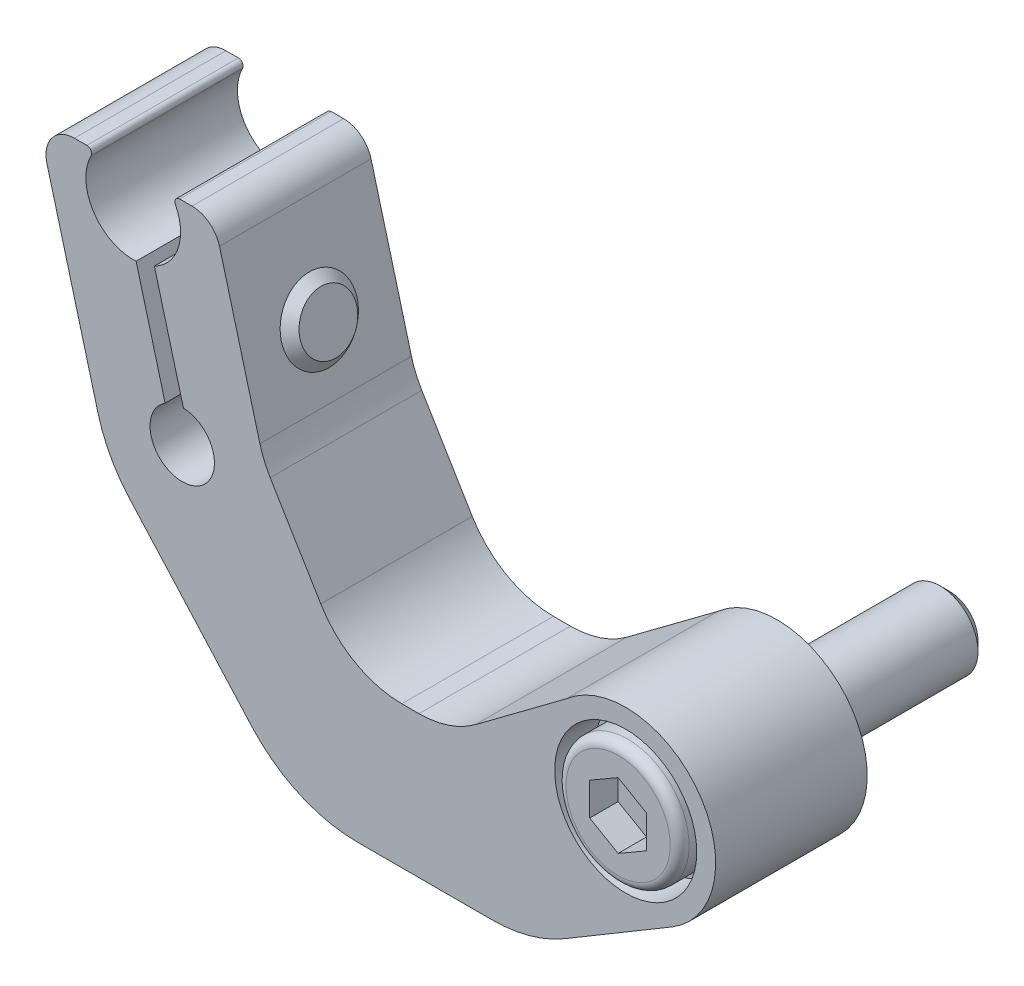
ISO-10303-21;
HEADER;
FILE_DESCRIPTION(('STEP AP214'),'2;1');
FILE_NAME('part.step','',(''),(''),'','','');
FILE_SCHEMA(('AUTOMOTIVE_DESIGN { 1 0 10303 214 1 1 1 1 }'));
ENDSEC;
DATA;
#1=APPLICATION_CONTEXT('core data for automotive mechanical design processes');
#2=APPLICATION_PROTOCOL_DEFINITION('international standard','automotive_design',2000,#1);
#3=PRODUCT_CONTEXT('',#1,'mechanical');
#4=PRODUCT('Part','Part','',(#3));
#5=PRODUCT_RELATED_PRODUCT_CATEGORY('part','',(#4));
#6=PRODUCT_DEFINITION_FORMATION('','',#4);
#7=PRODUCT_DEFINITION_CONTEXT('part definition',#1,'design');
#8=PRODUCT_DEFINITION('design','',#6,#7);
#9=PRODUCT_DEFINITION_SHAPE('','',#8);
#10=(LENGTH_UNIT() NAMED_UNIT(*) SI_UNIT(.MILLI.,.METRE.));
#11=(NAMED_UNIT(*) PLANE_ANGLE_UNIT() SI_UNIT($,.RADIAN.));
#12=(NAMED_UNIT(*) SI_UNIT($,.STERADIAN.) SOLID_ANGLE_UNIT());
#13=UNCERTAINTY_MEASURE_WITH_UNIT(LENGTH_MEASURE(1.E-05),#10,'distance_accuracy_value','');
#14=(GEOMETRIC_REPRESENTATION_CONTEXT(3) GLOBAL_UNCERTAINTY_ASSIGNED_CONTEXT((#13)) GLOBAL_UNIT_ASSIGNED_CONTEXT((#10,
#11,#12)) REPRESENTATION_CONTEXT('',''));
#15=CARTESIAN_POINT('',(0.,0.,0.));
#16=DIRECTION('',(0.,0.,1.));
#17=DIRECTION('',(1.,0.,0.));
#18=AXIS2_PLACEMENT_3D('',#15,#16,#17);
#19=CARTESIAN_POINT('',(0.,0.,11.8));
#20=DIRECTION('',(0.,0.,1.));
#21=DIRECTION('',(-0.410698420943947,-0.911771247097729,0.));
#22=AXIS2_PLACEMENT_3D('',#19,#20,#21);
#23=PLANE('',#22);
#24=CARTESIAN_POINT('',(0.,0.,11.8));
#25=DIRECTION('',(0.,0.,1.));
#26=DIRECTION('',(-0.410698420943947,-0.911771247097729,0.));
#27=AXIS2_PLACEMENT_3D('',#24,#25,#26);
#28=CIRCLE('',#27,7.45);
#29=CARTESIAN_POINT('',(-3.05970323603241,-6.79269579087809,11.8));
#30=VERTEX_POINT('',#29);
#31=EDGE_CURVE('E380',#30,#30,#28,.T.);
#32=ORIENTED_EDGE('',*,*,#31,.T.);
#33=EDGE_LOOP('',(#32));
#34=FACE_BOUND('',#33,.T.);
#35=CARTESIAN_POINT('',(0.,0.,11.8));
#36=DIRECTION('',(0.,0.,-1.));
#37=DIRECTION('',(0.,1.,0.));
#38=AXIS2_PLACEMENT_3D('',#35,#36,#37);
#39=CIRCLE('',#38,6.5);
#40=CARTESIAN_POINT('',(0.,6.5,11.8));
#41=VERTEX_POINT('',#40);
#42=EDGE_CURVE('E9',#41,#41,#39,.T.);
#43=ORIENTED_EDGE('',*,*,#42,.T.);
#44=EDGE_LOOP('',(#43));
#45=FACE_BOUND('',#44,.T.);
#46=ADVANCED_FACE('F14',(#34,#45),#23,.T.);
#47=CARTESIAN_POINT('',(0.,0.,11.8));
#48=DIRECTION('',(0.,0.,-1.));
#49=DIRECTION('',(0.410698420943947,0.911771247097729,0.));
#50=AXIS2_PLACEMENT_3D('',#47,#48,#49);
#51=CYLINDRICAL_SURFACE('',#50,7.45);
#52=ORIENTED_EDGE('',*,*,#31,.F.);
#53=EDGE_LOOP('',(#52));
#54=FACE_BOUND('',#53,.T.);
#55=CARTESIAN_POINT('',(0.,0.,11.));
#56=DIRECTION('',(0.,0.,1.));
#57=DIRECTION('',(-0.410698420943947,-0.911771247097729,0.));
#58=AXIS2_PLACEMENT_3D('',#55,#56,#57);
#59=CIRCLE('',#58,7.45);
#60=CARTESIAN_POINT('',(-3.05970323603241,-6.79269579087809,11.));
#61=VERTEX_POINT('',#60);
#62=EDGE_CURVE('E384',#61,#61,#59,.T.);
#63=ORIENTED_EDGE('',*,*,#62,.T.);
#64=EDGE_LOOP('',(#63));
#65=FACE_BOUND('',#64,.T.);
#66=ADVANCED_FACE('F749',(#54,#65),#51,.T.);
#67=CARTESIAN_POINT('',(0.,0.,11.));
#68=DIRECTION('',(0.,0.,1.));
#69=DIRECTION('',(-0.410698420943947,-0.911771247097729,0.));
#70=AXIS2_PLACEMENT_3D('',#67,#68,#69);
#71=PLANE('',#70);
#72=CARTESIAN_POINT('',(0.,0.,11.));
#73=DIRECTION('',(0.,0.,1.));
#74=DIRECTION('',(1.,0.,0.));
#75=AXIS2_PLACEMENT_3D('',#72,#73,#74);
#76=CIRCLE('',#75,5.);
#77=CARTESIAN_POINT('',(5.,0.,11.));
#78=VERTEX_POINT('',#77);
#79=EDGE_CURVE('E24',#78,#78,#76,.F.);
#80=ORIENTED_EDGE('',*,*,#79,.T.);
#81=EDGE_LOOP('',(#80));
#82=FACE_BOUND('',#81,.T.);
#83=CARTESIAN_POINT('',(0.,0.,11.));
#84=DIRECTION('',(0.,0.,1.));
#85=DIRECTION('',(-0.410698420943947,-0.911771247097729,0.));
#86=AXIS2_PLACEMENT_3D('',#83,#84,#85);
#87=CIRCLE('',#86,4.2);
#88=CARTESIAN_POINT('',(-1.72493336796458,-3.82943923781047,11.));
#89=VERTEX_POINT('',#88);
#90=EDGE_CURVE('E459',#89,#89,#87,.T.);
#91=ORIENTED_EDGE('',*,*,#90,.T.);
#92=EDGE_LOOP('',(#91));
#93=FACE_BOUND('',#92,.T.);
#94=ADVANCED_FACE('F746',(#82,#93),#71,.F.);
#95=CARTESIAN_POINT('',(0.,0.,11.8));
#96=DIRECTION('',(0.,0.,-1.));
#97=DIRECTION('',(0.410698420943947,0.911771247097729,0.));
#98=AXIS2_PLACEMENT_3D('',#95,#96,#97);
#99=CYLINDRICAL_SURFACE('',#98,4.2);
#100=CARTESIAN_POINT('',(0.,0.,11.8));
#101=DIRECTION('',(0.,0.,1.));
#102=DIRECTION('',(-0.410698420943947,-0.911771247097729,0.));
#103=AXIS2_PLACEMENT_3D('',#100,#101,#102);
#104=CIRCLE('',#103,4.2);
#105=CARTESIAN_POINT('',(-1.72493336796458,-3.82943923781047,11.8));
#106=VERTEX_POINT('',#105);
#107=EDGE_CURVE('E389',#106,#106,#104,.T.);
#108=ORIENTED_EDGE('',*,*,#107,.T.);
#109=EDGE_LOOP('',(#108));
#110=FACE_BOUND('',#109,.T.);
#111=ORIENTED_EDGE('',*,*,#90,.F.);
#112=EDGE_LOOP('',(#111));
#113=FACE_BOUND('',#112,.T.);
#114=ADVANCED_FACE('F748',(#110,#113),#99,.F.);
#115=CARTESIAN_POINT('',(-54.3074982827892,14.860511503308,5.23326676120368));
#116=DIRECTION('',(-0.965925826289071,-0.258819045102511,0.));
#117=DIRECTION('',(-0.155743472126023,0.581242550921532,0.798687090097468));
#118=AXIS2_PLACEMENT_3D('',#115,#116,#117);
#119=PLANE('',#118);
#120=DIRECTION('',(0.256892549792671,-0.958736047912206,0.1217842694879));
#121=VECTOR('',#120,1.);
#122=CARTESIAN_POINT('',(-54.3074982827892,14.860511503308,5.23326676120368));
#123=LINE('',#122,#121);
#124=CARTESIAN_POINT('',(-55.1974001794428,18.1816705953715,4.81139367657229));
#125=VERTEX_POINT('',#124);
#126=CARTESIAN_POINT('',(-54.3074982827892,14.860511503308,5.23326676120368));
#127=VERTEX_POINT('',#126);
#128=EDGE_CURVE('E478',#125,#127,#123,.T.);
#129=ORIENTED_EDGE('',*,*,#128,.T.);
#130=DIRECTION('',(0.101149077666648,-0.377493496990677,0.92047135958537));
#131=VECTOR('',#130,1.);
#132=CARTESIAN_POINT('',(-53.9571075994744,13.5528356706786,8.42187308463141));
#133=LINE('',#132,#131);
#134=CARTESIAN_POINT('',(-53.9571075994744,13.5528356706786,8.42187308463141));
#135=VERTEX_POINT('',#134);
#136=EDGE_CURVE('E481',#127,#135,#133,.T.);
#137=ORIENTED_EDGE('',*,*,#136,.T.);
#138=DIRECTION('',(-0.155743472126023,0.581242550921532,0.798687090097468));
#139=VECTOR('',#138,1.);
#140=CARTESIAN_POINT('',(-54.4966188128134,15.5663189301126,11.1886063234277));
#141=LINE('',#140,#139);
#142=CARTESIAN_POINT('',(-54.4966188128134,15.5663189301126,11.1886063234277));
#143=VERTEX_POINT('',#142);
#144=EDGE_CURVE('E484',#135,#143,#141,.T.);
#145=ORIENTED_EDGE('',*,*,#144,.T.);
#146=DIRECTION('',(-0.256892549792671,0.958736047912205,-0.121784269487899));
#147=VECTOR('',#146,1.);
#148=CARTESIAN_POINT('',(-55.386520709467,18.8874780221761,10.7667332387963));
#149=LINE('',#148,#147);
#150=CARTESIAN_POINT('',(-55.386520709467,18.8874780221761,10.7667332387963));
#151=VERTEX_POINT('',#150);
#152=EDGE_CURVE('E487',#143,#151,#149,.T.);
#153=ORIENTED_EDGE('',*,*,#152,.T.);
#154=DIRECTION('',(-0.101149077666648,0.377493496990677,-0.92047135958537));
#155=VECTOR('',#154,1.);
#156=CARTESIAN_POINT('',(-55.7369113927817,20.1951538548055,7.57812691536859));
#157=LINE('',#156,#155);
#158=CARTESIAN_POINT('',(-55.7369113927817,20.1951538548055,7.57812691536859));
#159=VERTEX_POINT('',#158);
#160=EDGE_CURVE('E490',#151,#159,#157,.T.);
#161=ORIENTED_EDGE('',*,*,#160,.T.);
#162=DIRECTION('',(0.155743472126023,-0.581242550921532,-0.798687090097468));
#163=VECTOR('',#162,1.);
#164=CARTESIAN_POINT('',(-55.1974001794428,18.1816705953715,4.81139367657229));
#165=LINE('',#164,#163);
#166=EDGE_CURVE('E493',#159,#125,#165,.T.);
#167=ORIENTED_EDGE('',*,*,#166,.T.);
#168=EDGE_LOOP('',(#129,#137,#145,#153,#161,#167));
#169=FACE_BOUND('',#168,.T.);
#170=ADVANCED_FACE('F756',(#169),#119,.T.);
#171=CARTESIAN_POINT('',(-54.4966188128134,15.5663189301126,11.1886063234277));
#172=DIRECTION('',(0.206715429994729,-0.771472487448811,0.601746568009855));
#173=DIRECTION('',(-0.155743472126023,0.581242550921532,0.798687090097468));
#174=AXIS2_PLACEMENT_3D('',#171,#172,#173);
#175=PLANE('',#174);
#176=DIRECTION('',(-0.155743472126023,0.581242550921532,0.798687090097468));
#177=VECTOR('',#176,1.);
#178=CARTESIAN_POINT('',(-57.3943962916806,14.7898617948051,11.1886063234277));
#179=LINE('',#178,#177);
#180=CARTESIAN_POINT('',(-56.8548850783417,12.776378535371,8.42187308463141));
#181=VERTEX_POINT('',#180);
#182=CARTESIAN_POINT('',(-57.3943962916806,14.7898617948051,11.1886063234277));
#183=VERTEX_POINT('',#182);
#184=EDGE_CURVE('E466',#181,#183,#179,.T.);
#185=ORIENTED_EDGE('',*,*,#184,.T.);
#186=DIRECTION('',(-0.965925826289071,-0.258819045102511,0.));
#187=VECTOR('',#186,1.);
#188=CARTESIAN_POINT('',(-54.4966188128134,15.5663189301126,11.1886063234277));
#189=LINE('',#188,#187);
#190=EDGE_CURVE('E504',#143,#183,#189,.T.);
#191=ORIENTED_EDGE('',*,*,#190,.F.);
#192=ORIENTED_EDGE('',*,*,#144,.F.);
#193=DIRECTION('',(-0.965925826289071,-0.258819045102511,0.));
#194=VECTOR('',#193,1.);
#195=CARTESIAN_POINT('',(-53.9571075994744,13.5528356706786,8.42187308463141));
#196=LINE('',#195,#194);
#197=EDGE_CURVE('E506',#135,#181,#196,.T.);
#198=ORIENTED_EDGE('',*,*,#197,.T.);
#199=EDGE_LOOP('',(#185,#191,#192,#198));
#200=FACE_BOUND('',#199,.T.);
#201=ADVANCED_FACE('F824',(#200),#175,.F.);
#202=CARTESIAN_POINT('',(-55.386520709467,18.8874780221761,10.7667332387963));
#203=DIRECTION('',(-0.0315200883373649,0.11763457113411,0.992556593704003));
#204=DIRECTION('',(-0.256892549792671,0.958736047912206,-0.1217842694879));
#205=AXIS2_PLACEMENT_3D('',#202,#203,#204);
#206=PLANE('',#205);
#207=DIRECTION('',(-0.256892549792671,0.958736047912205,-0.121784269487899));
#208=VECTOR('',#207,1.);
#209=CARTESIAN_POINT('',(-58.2842981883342,18.1110208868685,10.7667332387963));
#210=LINE('',#209,#208);
#211=CARTESIAN_POINT('',(-58.2842981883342,18.1110208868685,10.7667332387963));
#212=VERTEX_POINT('',#211);
#213=EDGE_CURVE('E469',#183,#212,#210,.T.);
#214=ORIENTED_EDGE('',*,*,#213,.T.);
#215=DIRECTION('',(-0.965925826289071,-0.258819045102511,0.));
#216=VECTOR('',#215,1.);
#217=CARTESIAN_POINT('',(-55.386520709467,18.8874780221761,10.7667332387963));
#218=LINE('',#217,#216);
#219=EDGE_CURVE('E502',#151,#212,#218,.T.);
#220=ORIENTED_EDGE('',*,*,#219,.F.);
#221=ORIENTED_EDGE('',*,*,#152,.F.);
#222=ORIENTED_EDGE('',*,*,#190,.T.);
#223=EDGE_LOOP('',(#214,#220,#221,#222));
#224=FACE_BOUND('',#223,.T.);
#225=ADVANCED_FACE('F835',(#224),#206,.F.);
#226=CARTESIAN_POINT('',(-55.7369113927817,20.1951538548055,7.57812691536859));
#227=DIRECTION('',(-0.238235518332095,0.889107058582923,0.390810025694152));
#228=DIRECTION('',(-0.101149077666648,0.377493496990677,-0.92047135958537));
#229=AXIS2_PLACEMENT_3D('',#226,#227,#228);
#230=PLANE('',#229);
#231=DIRECTION('',(-0.101149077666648,0.377493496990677,-0.92047135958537));
#232=VECTOR('',#231,1.);
#233=CARTESIAN_POINT('',(-58.6346888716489,19.418696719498,7.57812691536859));
#234=LINE('',#233,#232);
#235=CARTESIAN_POINT('',(-58.6346888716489,19.418696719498,7.57812691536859));
#236=VERTEX_POINT('',#235);
#237=EDGE_CURVE('E472',#212,#236,#234,.T.);
#238=ORIENTED_EDGE('',*,*,#237,.T.);
#239=DIRECTION('',(-0.965925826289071,-0.258819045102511,0.));
#240=VECTOR('',#239,1.);
#241=CARTESIAN_POINT('',(-55.7369113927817,20.1951538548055,7.57812691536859));
#242=LINE('',#241,#240);
#243=EDGE_CURVE('E500',#159,#236,#242,.T.);
#244=ORIENTED_EDGE('',*,*,#243,.F.);
#245=ORIENTED_EDGE('',*,*,#160,.F.);
#246=ORIENTED_EDGE('',*,*,#219,.T.);
#247=EDGE_LOOP('',(#238,#244,#245,#246));
#248=FACE_BOUND('',#247,.T.);
#249=ADVANCED_FACE('F831',(#248),#230,.F.);
#250=CARTESIAN_POINT('',(-55.1974001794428,18.1816705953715,4.81139367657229));
#251=DIRECTION('',(-0.206715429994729,0.771472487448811,-0.601746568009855));
#252=DIRECTION('',(0.155743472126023,-0.581242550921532,-0.798687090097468));
#253=AXIS2_PLACEMENT_3D('',#250,#251,#252);
#254=PLANE('',#253);
#255=DIRECTION('',(0.155743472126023,-0.581242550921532,-0.798687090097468));
#256=VECTOR('',#255,1.);
#257=CARTESIAN_POINT('',(-58.09517765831,17.4052134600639,4.81139367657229));
#258=LINE('',#257,#256);
#259=CARTESIAN_POINT('',(-58.09517765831,17.4052134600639,4.81139367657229));
#260=VERTEX_POINT('',#259);
#261=EDGE_CURVE('E475',#236,#260,#258,.T.);
#262=ORIENTED_EDGE('',*,*,#261,.T.);
#263=DIRECTION('',(-0.965925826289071,-0.258819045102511,0.));
#264=VECTOR('',#263,1.);
#265=CARTESIAN_POINT('',(-55.1974001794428,18.1816705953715,4.81139367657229));
#266=LINE('',#265,#264);
#267=EDGE_CURVE('E497',#125,#260,#266,.T.);
#268=ORIENTED_EDGE('',*,*,#267,.F.);
#269=ORIENTED_EDGE('',*,*,#166,.F.);
#270=ORIENTED_EDGE('',*,*,#243,.T.);
#271=EDGE_LOOP('',(#262,#268,#269,#270));
#272=FACE_BOUND('',#271,.T.);
#273=ADVANCED_FACE('F827',(#272),#254,.F.);
#274=CARTESIAN_POINT('',(-54.3074982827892,14.860511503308,5.23326676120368));
#275=DIRECTION('',(0.0315200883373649,-0.11763457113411,-0.992556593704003));
#276=DIRECTION('',(0.256892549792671,-0.958736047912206,0.1217842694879));
#277=AXIS2_PLACEMENT_3D('',#274,#275,#276);
#278=PLANE('',#277);
#279=DIRECTION('',(0.256892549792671,-0.958736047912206,0.1217842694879));
#280=VECTOR('',#279,1.);
#281=CARTESIAN_POINT('',(-57.2052757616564,14.0840543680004,5.23326676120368));
#282=LINE('',#281,#280);
#283=CARTESIAN_POINT('',(-57.2052757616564,14.0840543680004,5.23326676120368));
#284=VERTEX_POINT('',#283);
#285=EDGE_CURVE('E460',#260,#284,#282,.T.);
#286=ORIENTED_EDGE('',*,*,#285,.T.);
#287=DIRECTION('',(-0.965925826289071,-0.258819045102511,0.));
#288=VECTOR('',#287,1.);
#289=CARTESIAN_POINT('',(-54.3074982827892,14.860511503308,5.23326676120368));
#290=LINE('',#289,#288);
#291=EDGE_CURVE('E496',#127,#284,#290,.T.);
#292=ORIENTED_EDGE('',*,*,#291,.F.);
#293=ORIENTED_EDGE('',*,*,#128,.F.);
#294=ORIENTED_EDGE('',*,*,#267,.T.);
#295=EDGE_LOOP('',(#286,#292,#293,#294));
#296=FACE_BOUND('',#295,.T.);
#297=ADVANCED_FACE('F830',(#296),#278,.F.);
#298=CARTESIAN_POINT('',(-53.9571075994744,13.5528356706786,8.42187308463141));
#299=DIRECTION('',(0.238235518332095,-0.889107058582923,-0.390810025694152));
#300=DIRECTION('',(0.101149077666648,-0.377493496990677,0.92047135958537));
#301=AXIS2_PLACEMENT_3D('',#298,#299,#300);
#302=PLANE('',#301);
#303=DIRECTION('',(0.101149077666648,-0.377493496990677,0.92047135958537));
#304=VECTOR('',#303,1.);
#305=CARTESIAN_POINT('',(-56.8548850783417,12.776378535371,8.42187308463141));
#306=LINE('',#305,#304);
#307=EDGE_CURVE('E462',#284,#181,#306,.T.);
#308=ORIENTED_EDGE('',*,*,#307,.T.);
#309=ORIENTED_EDGE('',*,*,#197,.F.);
#310=ORIENTED_EDGE('',*,*,#136,.F.);
#311=ORIENTED_EDGE('',*,*,#291,.T.);
#312=EDGE_LOOP('',(#308,#309,#310,#311));
#313=FACE_BOUND('',#312,.T.);
#314=ADVANCED_FACE('F826',(#313),#302,.F.);
#315=CARTESIAN_POINT('',(-57.7447869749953,16.0975376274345,8.));
#316=DIRECTION('',(0.965925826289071,0.258819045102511,0.));
#317=DIRECTION('',(0.155743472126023,-0.581242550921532,-0.798687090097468));
#318=AXIS2_PLACEMENT_3D('',#315,#316,#317);
#319=PLANE('',#318);
#320=ORIENTED_EDGE('',*,*,#307,.F.);
#321=ORIENTED_EDGE('',*,*,#285,.F.);
#322=ORIENTED_EDGE('',*,*,#261,.F.);
#323=ORIENTED_EDGE('',*,*,#237,.F.);
#324=ORIENTED_EDGE('',*,*,#213,.F.);
#325=ORIENTED_EDGE('',*,*,#184,.F.);
#326=EDGE_LOOP('',(#320,#321,#322,#323,#324,#325));
#327=FACE_BOUND('',#326,.T.);
#328=CARTESIAN_POINT('',(-57.7447869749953,16.0975376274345,8.));
#329=DIRECTION('',(0.965925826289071,0.258819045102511,0.));
#330=DIRECTION('',(0.155743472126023,-0.581242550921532,-0.798687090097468));
#331=AXIS2_PLACEMENT_3D('',#328,#329,#330);
#332=CIRCLE('',#331,5.5);
#333=CARTESIAN_POINT('',(-56.8881978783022,12.9007035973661,3.60722100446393));
#334=VERTEX_POINT('',#333);
#335=EDGE_CURVE('E518',#334,#334,#332,.F.);
#336=ORIENTED_EDGE('',*,*,#335,.T.);
#337=EDGE_LOOP('',(#336));
#338=FACE_BOUND('',#337,.T.);
#339=ADVANCED_FACE('F845',(#327,#338),#319,.F.);
#340=CARTESIAN_POINT('',(-56.7788611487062,16.356356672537,8.));
#341=DIRECTION('',(0.965925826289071,0.258819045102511,0.));
#342=DIRECTION('',(0.155743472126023,-0.581242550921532,-0.798687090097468));
#343=AXIS2_PLACEMENT_3D('',#340,#341,#342);
#344=TOROIDAL_SURFACE('',#343,5.5,1.);
#345=ORIENTED_EDGE('',*,*,#335,.F.);
#346=EDGE_LOOP('',(#345));
#347=FACE_BOUND('',#346,.T.);
#348=CARTESIAN_POINT('',(-56.7788611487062,16.356356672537,8.));
#349=DIRECTION('',(0.965925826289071,0.258819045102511,0.));
#350=DIRECTION('',(0.155743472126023,-0.581242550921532,-0.798687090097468));
#351=AXIS2_PLACEMENT_3D('',#348,#349,#350);
#352=CIRCLE('',#351,6.5);
#353=CARTESIAN_POINT('',(-55.7665285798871,12.5782800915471,2.80853391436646));
#354=VERTEX_POINT('',#353);
#355=EDGE_CURVE('E515',#354,#354,#352,.T.);
#356=ORIENTED_EDGE('',*,*,#355,.F.);
#357=EDGE_LOOP('',(#356));
#358=FACE_BOUND('',#357,.T.);
#359=ADVANCED_FACE('F850',(#347,#358),#344,.T.);
#360=CARTESIAN_POINT('',(0.,0.,-2.05));
#361=DIRECTION('',(0.,0.,1.));
#362=DIRECTION('',(0.837637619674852,0.546226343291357,0.));
#363=AXIS2_PLACEMENT_3D('',#360,#361,#362);
#364=TOROIDAL_SURFACE('',#363,4.55,0.45);
#365=CARTESIAN_POINT('',(0.,0.,-2.05));
#366=DIRECTION('',(0.,0.,1.));
#367=DIRECTION('',(0.837637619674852,0.546226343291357,0.));
#368=AXIS2_PLACEMENT_3D('',#365,#366,#367);
#369=CIRCLE('',#368,5.);
#370=CARTESIAN_POINT('',(4.18818809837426,2.73113171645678,-2.05));
#371=VERTEX_POINT('',#370);
#372=EDGE_CURVE('E534',#371,#371,#369,.T.);
#373=ORIENTED_EDGE('',*,*,#372,.F.);
#374=EDGE_LOOP('',(#373));
#375=FACE_BOUND('',#374,.T.);
#376=CARTESIAN_POINT('',(0.,0.,-2.05));
#377=DIRECTION('',(0.,0.,1.));
#378=DIRECTION('',(0.837637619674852,0.546226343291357,0.));
#379=AXIS2_PLACEMENT_3D('',#376,#377,#378);
#380=CIRCLE('',#379,4.1);
#381=CARTESIAN_POINT('',(3.43431424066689,2.23952800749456,-2.05));
#382=VERTEX_POINT('',#381);
#383=EDGE_CURVE('E537',#382,#382,#380,.T.);
#384=ORIENTED_EDGE('',*,*,#383,.T.);
#385=EDGE_LOOP('',(#384));
#386=FACE_BOUND('',#385,.T.);
#387=ADVANCED_FACE('F860',(#375,#386),#364,.T.);
#388=CARTESIAN_POINT('',(-39.392196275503,21.0150994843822,8.));
#389=DIRECTION('',(0.965925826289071,0.258819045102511,0.));
#390=DIRECTION('',(0.155743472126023,-0.581242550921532,-0.798687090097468));
#391=AXIS2_PLACEMENT_3D('',#388,#389,#390);
#392=CYLINDRICAL_SURFACE('',#391,6.5);
#393=CARTESIAN_POINT('',(-52.9151578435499,17.3916328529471,8.));
#394=DIRECTION('',(0.965925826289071,0.258819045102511,0.));
#395=DIRECTION('',(0.155743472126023,-0.581242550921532,-0.798687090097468));
#396=AXIS2_PLACEMENT_3D('',#393,#394,#395);
#397=CIRCLE('',#396,6.5);
#398=CARTESIAN_POINT('',(-51.9028252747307,13.6135562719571,2.80853391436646));
#399=VERTEX_POINT('',#398);
#400=EDGE_CURVE('E512',#399,#399,#397,.T.);
#401=CARTESIAN_POINT('',(-55.7665285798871,12.5782800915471,2.80853391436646));
#402=CARTESIAN_POINT('',(-55.7262816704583,12.5890642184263,2.80853391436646));
#403=CARTESIAN_POINT('',(-55.6860347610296,12.5998483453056,2.80853391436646));
#404=CARTESIAN_POINT('',(-55.6055409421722,12.6214165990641,2.80853391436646));
#405=CARTESIAN_POINT('',(-55.5652940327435,12.6322007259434,2.80853391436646));
#406=CARTESIAN_POINT('',(-55.4848002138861,12.653768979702,2.80853391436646));
#407=CARTESIAN_POINT('',(-55.4445533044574,12.6645531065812,2.80853391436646));
#408=CARTESIAN_POINT('',(-55.3640594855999,12.6861213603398,2.80853391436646));
#409=CARTESIAN_POINT('',(-55.3238125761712,12.696905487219,2.80853391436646));
#410=CARTESIAN_POINT('',(-55.2433187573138,12.7184737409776,2.80853391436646));
#411=CARTESIAN_POINT('',(-55.2030718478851,12.7292578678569,2.80853391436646));
#412=CARTESIAN_POINT('',(-55.1225780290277,12.7508261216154,2.80853391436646));
#413=CARTESIAN_POINT('',(-55.082331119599,12.7616102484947,2.80853391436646));
#414=CARTESIAN_POINT('',(-55.0018373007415,12.7831785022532,2.80853391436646));
#415=CARTESIAN_POINT('',(-54.9615903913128,12.7939626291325,2.80853391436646));
#416=CARTESIAN_POINT('',(-54.8810965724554,12.815530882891,2.80853391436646));
#417=CARTESIAN_POINT('',(-54.8408496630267,12.8263150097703,2.80853391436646));
#418=CARTESIAN_POINT('',(-54.7603558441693,12.8478832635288,2.80853391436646));
#419=CARTESIAN_POINT('',(-54.7201089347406,12.8586673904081,2.80853391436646));
#420=CARTESIAN_POINT('',(-54.6396151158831,12.8802356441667,2.80853391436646));
#421=CARTESIAN_POINT('',(-54.5993682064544,12.8910197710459,2.80853391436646));
#422=CARTESIAN_POINT('',(-54.518874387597,12.9125880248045,2.80853391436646));
#423=CARTESIAN_POINT('',(-54.4786274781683,12.9233721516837,2.80853391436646));
#424=CARTESIAN_POINT('',(-54.3981336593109,12.9449404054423,2.80853391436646));
#425=CARTESIAN_POINT('',(-54.3578867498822,12.9557245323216,2.80853391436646));
#426=CARTESIAN_POINT('',(-54.2773929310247,12.9772927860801,2.80853391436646));
#427=CARTESIAN_POINT('',(-54.237146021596,12.9880769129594,2.80853391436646));
#428=CARTESIAN_POINT('',(-54.1566522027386,13.0096451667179,2.80853391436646));
#429=CARTESIAN_POINT('',(-54.1164052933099,13.0204292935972,2.80853391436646));
#430=CARTESIAN_POINT('',(-54.0359114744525,13.0419975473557,2.80853391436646));
#431=CARTESIAN_POINT('',(-53.9956645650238,13.052781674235,2.80853391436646));
#432=CARTESIAN_POINT('',(-53.9151707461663,13.0743499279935,2.80853391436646));
#433=CARTESIAN_POINT('',(-53.8749238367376,13.0851340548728,2.80853391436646));
#434=CARTESIAN_POINT('',(-53.7944300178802,13.1067023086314,2.80853391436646));
#435=CARTESIAN_POINT('',(-53.7541831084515,13.1174864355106,2.80853391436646));
#436=CARTESIAN_POINT('',(-53.6736892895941,13.1390546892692,2.80853391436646));
#437=CARTESIAN_POINT('',(-53.6334423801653,13.1498388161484,2.80853391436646));
#438=CARTESIAN_POINT('',(-53.5529485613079,13.171407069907,2.80853391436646));
#439=CARTESIAN_POINT('',(-53.5127016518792,13.1821911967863,2.80853391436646));
#440=CARTESIAN_POINT('',(-53.4322078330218,13.2037594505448,2.80853391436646));
#441=CARTESIAN_POINT('',(-53.3919609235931,13.2145435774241,2.80853391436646));
#442=CARTESIAN_POINT('',(-53.3114671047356,13.2361118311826,2.80853391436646));
#443=CARTESIAN_POINT('',(-53.2712201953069,13.2468959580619,2.80853391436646));
#444=CARTESIAN_POINT('',(-53.1907263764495,13.2684642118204,2.80853391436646));
#445=CARTESIAN_POINT('',(-53.1504794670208,13.2792483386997,2.80853391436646));
#446=CARTESIAN_POINT('',(-53.0699856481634,13.3008165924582,2.80853391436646));
#447=CARTESIAN_POINT('',(-53.0297387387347,13.3116007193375,2.80853391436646));
#448=CARTESIAN_POINT('',(-52.9492449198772,13.333168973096,2.80853391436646));
#449=CARTESIAN_POINT('',(-52.9089980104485,13.3439530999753,2.80853391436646));
#450=CARTESIAN_POINT('',(-52.8285041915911,13.3655213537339,2.80853391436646));
#451=CARTESIAN_POINT('',(-52.7882572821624,13.3763054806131,2.80853391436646));
#452=CARTESIAN_POINT('',(-52.707763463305,13.3978737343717,2.80853391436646));
#453=CARTESIAN_POINT('',(-52.6675165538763,13.4086578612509,2.80853391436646));
#454=CARTESIAN_POINT('',(-52.5870227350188,13.4302261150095,2.80853391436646));
#455=CARTESIAN_POINT('',(-52.5467758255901,13.4410102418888,2.80853391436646));
#456=CARTESIAN_POINT('',(-52.4662820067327,13.4625784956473,2.80853391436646));
#457=CARTESIAN_POINT('',(-52.426035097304,13.4733626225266,2.80853391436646));
#458=CARTESIAN_POINT('',(-52.3455412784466,13.4949308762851,2.80853391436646));
#459=CARTESIAN_POINT('',(-52.3052943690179,13.5057150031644,2.80853391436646));
#460=CARTESIAN_POINT('',(-52.2248005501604,13.5272832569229,2.80853391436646));
#461=CARTESIAN_POINT('',(-52.1845536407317,13.5380673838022,2.80853391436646));
#462=CARTESIAN_POINT('',(-52.1040598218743,13.5596356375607,2.80853391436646));
#463=CARTESIAN_POINT('',(-52.0638129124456,13.57041976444,2.80853391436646));
#464=CARTESIAN_POINT('',(-51.9833190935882,13.5919880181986,2.80853391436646));
#465=CARTESIAN_POINT('',(-51.9430721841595,13.6027721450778,2.80853391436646));
#466=CARTESIAN_POINT('',(-51.9028252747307,13.6135562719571,2.80853391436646));
#467=B_SPLINE_CURVE_WITH_KNOTS('',3,(#401,#402,#403,#404,#405,#406,#407,#408,#409,#410,#411,
#412,#413,#414,#415,#416,#417,#418,#419,#420,#421,#422,#423,#424,#425,#426,#427,#428,#429,#430,
#431,#432,#433,#434,#435,#436,#437,#438,#439,#440,#441,#442,#443,#444,#445,#446,#447,#448,#449,
#450,#451,#452,#453,#454,#455,#456,#457,#458,#459,#460,#461,#462,#463,#464,#465,#466),
.UNSPECIFIED.,.F.,.F.,(4,2,2,2,2,2,2,2,2,2,2,2,2,2,2,2,2,2,2,2,2,2,2,2,2,2,2,2,2,2,2,2,4),(0.,
0.125000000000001,0.25,0.375000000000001,0.5,0.625000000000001,0.750000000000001,
0.875000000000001,1.,1.125,1.25,1.375,1.5,1.625,1.75000000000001,1.87500000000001,
2.00000000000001,2.12500000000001,2.25000000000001,2.37500000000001,2.50000000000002,
2.62500000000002,2.75000000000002,2.87500000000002,3.00000000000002,3.12500000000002,
3.25000000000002,3.37500000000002,3.50000000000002,3.62500000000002,3.75000000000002,
3.87500000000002,4.00000000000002),.UNSPECIFIED.);
#468=EDGE_CURVE('BSEAM862',#354,#399,#467,.T.);
#469=ORIENTED_EDGE('',*,*,#355,.T.);
#470=ORIENTED_EDGE('',*,*,#400,.F.);
#471=ORIENTED_EDGE('',*,*,#468,.T.);
#472=ORIENTED_EDGE('',*,*,#468,.F.);
#473=EDGE_LOOP('',(#469,#471,#470,#472));
#474=FACE_BOUND('',#473,.T.);
#475=ADVANCED_FACE('F862',(#474),#392,.T.);
#476=CARTESIAN_POINT('',(0.,0.,4.7));
#477=DIRECTION('',(0.,0.,1.));
#478=DIRECTION('',(0.837637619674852,0.546226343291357,0.));
#479=AXIS2_PLACEMENT_3D('',#476,#477,#478);
#480=CYLINDRICAL_SURFACE('',#479,5.);
#481=CARTESIAN_POINT('',(0.,0.,0.));
#482=DIRECTION('',(0.,0.,1.));
#483=DIRECTION('',(0.837637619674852,0.546226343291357,0.));
#484=AXIS2_PLACEMENT_3D('',#481,#482,#483);
#485=CIRCLE('',#484,5.);
#486=CARTESIAN_POINT('',(4.18818809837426,2.73113171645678,0.));
#487=VERTEX_POINT('',#486);
#488=EDGE_CURVE('E378',#487,#487,#485,.T.);
#489=ORIENTED_EDGE('',*,*,#488,.F.);
#490=EDGE_LOOP('',(#489));
#491=FACE_BOUND('',#490,.T.);
#492=ORIENTED_EDGE('',*,*,#372,.T.);
#493=EDGE_LOOP('',(#492));
#494=FACE_BOUND('',#493,.T.);
#495=ADVANCED_FACE('F877',(#491,#494),#480,.T.);
#496=CARTESIAN_POINT('',(-52.9151578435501,17.391632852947,12.5));
#497=DIRECTION('',(0.965925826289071,0.258819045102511,0.));
#498=DIRECTION('',(-0.258819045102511,0.965925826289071,0.));
#499=AXIS2_PLACEMENT_3D('',#496,#497,#498);
#500=PLANE('',#499);
#501=CARTESIAN_POINT('',(-52.9151578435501,17.391632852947,8.));
#502=DIRECTION('',(-0.965925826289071,-0.258819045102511,0.));
#503=DIRECTION('',(0.258819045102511,-0.965925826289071,0.));
#504=AXIS2_PLACEMENT_3D('',#501,#502,#503);
#505=CIRCLE('',#504,7.5);
#506=CARTESIAN_POINT('',(-50.9740150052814,10.1471891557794,8.));
#507=VERTEX_POINT('',#506);
#508=EDGE_CURVE('E551',#507,#507,#505,.T.);
#509=ORIENTED_EDGE('',*,*,#508,.T.);
#510=EDGE_LOOP('',(#509));
#511=FACE_BOUND('',#510,.T.);
#512=ORIENTED_EDGE('',*,*,#400,.T.);
#513=EDGE_LOOP('',(#512));
#514=FACE_BOUND('',#513,.T.);
#515=ADVANCED_FACE('F873',(#511,#514),#500,.F.);
#516=CARTESIAN_POINT('',(-54.2588081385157,22.4062040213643,4.08864730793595));
#517=DIRECTION('',(-0.965925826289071,-0.258819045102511,0.));
#518=DIRECTION('',(-0.155743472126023,0.581242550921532,0.798687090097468));
#519=AXIS2_PLACEMENT_3D('',#516,#517,#518);
#520=PLANE('',#519);
#521=CARTESIAN_POINT('',(-52.9151578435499,17.3916328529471,8.));
#522=DIRECTION('',(0.965925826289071,0.258819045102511,0.));
#523=DIRECTION('',(0.155743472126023,-0.581242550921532,-0.798687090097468));
#524=AXIS2_PLACEMENT_3D('',#521,#522,#523);
#525=CIRCLE('',#524,4.);
#526=CARTESIAN_POINT('',(-52.2921839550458,15.0666626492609,4.80525163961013));
#527=VERTEX_POINT('',#526);
#528=EDGE_CURVE('E499',#527,#527,#525,.T.);
#529=ORIENTED_EDGE('',*,*,#528,.F.);
#530=EDGE_LOOP('',(#529));
#531=FACE_BOUND('',#530,.T.);
#532=CARTESIAN_POINT('',(-52.91515784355,17.3916328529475,8.));
#533=DIRECTION('',(-0.965925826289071,-0.258819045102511,0.));
#534=DIRECTION('',(0.258819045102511,-0.965925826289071,0.));
#535=AXIS2_PLACEMENT_3D('',#532,#533,#534);
#536=CIRCLE('',#535,4.5);
#537=CARTESIAN_POINT('',(-51.7504721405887,13.0449666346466,8.));
#538=VERTEX_POINT('',#537);
#539=EDGE_CURVE('E395',#538,#538,#536,.T.);
#540=ORIENTED_EDGE('',*,*,#539,.F.);
#541=EDGE_LOOP('',(#540));
#542=FACE_BOUND('',#541,.T.);
#543=ADVANCED_FACE('F856',(#531,#542),#520,.F.);
#544=CARTESIAN_POINT('',(-40.2190579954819,24.1009894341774,5.59301372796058));
#545=DIRECTION('',(-0.965925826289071,-0.258819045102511,0.));
#546=DIRECTION('',(-0.155743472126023,0.581242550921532,0.798687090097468));
#547=AXIS2_PLACEMENT_3D('',#544,#545,#546);
#548=PLANE('',#547);
#549=CARTESIAN_POINT('',(-39.392196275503,21.0150994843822,8.));
#550=DIRECTION('',(-0.965925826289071,-0.258819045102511,0.));
#551=DIRECTION('',(-0.155743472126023,0.581242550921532,0.798687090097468));
#552=AXIS2_PLACEMENT_3D('',#549,#550,#551);
#553=CIRCLE('',#552,3.);
#554=CARTESIAN_POINT('',(-39.859426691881,22.7588271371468,10.3960612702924));
#555=VERTEX_POINT('',#554);
#556=EDGE_CURVE('E521',#555,#555,#553,.F.);
#557=ORIENTED_EDGE('',*,*,#556,.T.);
#558=EDGE_LOOP('',(#557));
#559=FACE_BOUND('',#558,.T.);
#560=ADVANCED_FACE('F857',(#559),#548,.F.);
#561=CARTESIAN_POINT('',(-2.73113171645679,4.18818809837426,0.));
#562=DIRECTION('',(0.,0.,1.));
#563=DIRECTION('',(0.837637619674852,0.546226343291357,0.));
#564=AXIS2_PLACEMENT_3D('',#561,#562,#563);
#565=PLANE('',#564);
#566=ORIENTED_EDGE('',*,*,#488,.T.);
#567=EDGE_LOOP('',(#566));
#568=FACE_BOUND('',#567,.T.);
#569=CARTESIAN_POINT('',(-21.836045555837,8.,0.));
#570=DIRECTION('',(0.,0.,-1.));
#571=DIRECTION('',(1.,0.,0.));
#572=AXIS2_PLACEMENT_3D('',#569,#570,#571);
#573=CIRCLE('',#572,10.);
#574=CARTESIAN_POINT('',(-15.855599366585,-0.0146280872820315,0.));
#575=VERTEX_POINT('',#574);
#576=CARTESIAN_POINT('',(-21.836045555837,-2.,0.));
#577=VERTEX_POINT('',#576);
#578=EDGE_CURVE('E569',#575,#577,#573,.T.);
#579=ORIENTED_EDGE('',*,*,#578,.F.);
#580=DIRECTION('',(-0.801462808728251,-0.598044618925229,0.));
#581=VECTOR('',#580,1.);
#582=CARTESIAN_POINT('',(-15.855599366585,-0.0146280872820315,0.));
#583=LINE('',#582,#581);
#584=CARTESIAN_POINT('',(-6.26208111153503,7.14397229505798,0.));
#585=VERTEX_POINT('',#584);
#586=EDGE_CURVE('E248',#585,#575,#583,.T.);
#587=ORIENTED_EDGE('',*,*,#586,.F.);
#588=CARTESIAN_POINT('',(0.,0.,0.));
#589=DIRECTION('',(0.,0.,1.));
#590=DIRECTION('',(1.,0.,0.));
#591=AXIS2_PLACEMENT_3D('',#588,#589,#590);
#592=CIRCLE('',#591,9.49999999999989);
#593=CARTESIAN_POINT('',(4.85585691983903,-8.16520995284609,0.));
#594=VERTEX_POINT('',#593);
#595=EDGE_CURVE('E260',#594,#585,#592,.T.);
#596=ORIENTED_EDGE('',*,*,#595,.F.);
#597=DIRECTION('',(0.859495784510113,0.511142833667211,0.));
#598=VECTOR('',#597,1.);
#599=CARTESIAN_POINT('',(-6.45609486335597,-14.8924367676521,0.));
#600=LINE('',#599,#598);
#601=CARTESIAN_POINT('',(-6.45609486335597,-14.8924367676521,0.));
#602=VERTEX_POINT('',#601);
#603=EDGE_CURVE('E615',#602,#594,#600,.T.);
#604=ORIENTED_EDGE('',*,*,#603,.F.);
#605=CARTESIAN_POINT('',(-14.123237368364,-2.,0.));
#606=DIRECTION('',(0.,0.,1.));
#607=DIRECTION('',(1.,0.,0.));
#608=AXIS2_PLACEMENT_3D('',#605,#606,#607);
#609=CIRCLE('',#608,15.);
#610=CARTESIAN_POINT('',(-14.123237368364,-17.,0.));
#611=VERTEX_POINT('',#610);
#612=EDGE_CURVE('E613',#611,#602,#609,.T.);
#613=ORIENTED_EDGE('',*,*,#612,.F.);
#614=DIRECTION('',(1.,0.,0.));
#615=VECTOR('',#614,1.);
#616=CARTESIAN_POINT('',(-28.304162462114,-17.,0.));
#617=LINE('',#616,#615);
#618=CARTESIAN_POINT('',(-28.304162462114,-17.,0.));
#619=VERTEX_POINT('',#618);
#620=EDGE_CURVE('E611',#619,#611,#617,.T.);
#621=ORIENTED_EDGE('',*,*,#620,.F.);
#622=CARTESIAN_POINT('',(-28.304162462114,-2.,0.));
#623=DIRECTION('',(0.,0.,1.));
#624=DIRECTION('',(1.,0.,0.));
#625=AXIS2_PLACEMENT_3D('',#622,#623,#624);
#626=CIRCLE('',#625,15.);
#627=CARTESIAN_POINT('',(-39.4707471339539,-12.01535754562,0.));
#628=VERTEX_POINT('',#627);
#629=EDGE_CURVE('E609',#628,#619,#626,.T.);
#630=ORIENTED_EDGE('',*,*,#629,.F.);
#631=DIRECTION('',(0.667690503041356,-0.744438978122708,0.));
#632=VECTOR('',#631,1.);
#633=CARTESIAN_POINT('',(-52.3937380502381,2.39308185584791,0.));
#634=LINE('',#633,#632);
#635=CARTESIAN_POINT('',(-52.3937380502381,2.39308185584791,0.));
#636=VERTEX_POINT('',#635);
#637=EDGE_CURVE('E607',#636,#628,#634,.T.);
#638=ORIENTED_EDGE('',*,*,#637,.F.);
#639=CARTESIAN_POINT('',(-41.227153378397,12.408439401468,0.));
#640=DIRECTION('',(0.,0.,1.));
#641=DIRECTION('',(1.,0.,0.));
#642=AXIS2_PLACEMENT_3D('',#639,#640,#641);
#643=CIRCLE('',#642,15.);
#644=CARTESIAN_POINT('',(-55.716040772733,8.52615372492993,0.));
#645=VERTEX_POINT('',#644);
#646=EDGE_CURVE('E605',#645,#636,#643,.T.);
#647=ORIENTED_EDGE('',*,*,#646,.F.);
#648=DIRECTION('',(0.258819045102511,-0.965925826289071,0.));
#649=VECTOR('',#648,1.);
#650=CARTESIAN_POINT('',(-61.109434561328,28.6545733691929,0.));
#651=LINE('',#650,#649);
#652=CARTESIAN_POINT('',(-61.109434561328,28.6545733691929,0.));
#653=VERTEX_POINT('',#652);
#654=EDGE_CURVE('E603',#653,#645,#651,.T.);
#655=ORIENTED_EDGE('',*,*,#654,.F.);
#656=CARTESIAN_POINT('',(-58.211657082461,29.4310305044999,0.));
#657=DIRECTION('',(0.,0.,1.));
#658=DIRECTION('',(1.,0.,0.));
#659=AXIS2_PLACEMENT_3D('',#656,#657,#658);
#660=CIRCLE('',#659,3.);
#661=CARTESIAN_POINT('',(-58.211657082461,32.4310305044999,0.));
#662=VERTEX_POINT('',#661);
#663=EDGE_CURVE('E601',#662,#653,#660,.T.);
#664=ORIENTED_EDGE('',*,*,#663,.F.);
#665=DIRECTION('',(-1.,0.,0.));
#666=VECTOR('',#665,1.);
#667=CARTESIAN_POINT('',(-56.8989794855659,32.4310305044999,0.));
#668=LINE('',#667,#666);
#669=CARTESIAN_POINT('',(-56.8989794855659,32.4310305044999,0.));
#670=VERTEX_POINT('',#669);
#671=EDGE_CURVE('E599',#670,#662,#668,.T.);
#672=ORIENTED_EDGE('',*,*,#671,.F.);
#673=CARTESIAN_POINT('',(-56.8989794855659,31.9310305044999,0.));
#674=DIRECTION('',(0.,0.,1.));
#675=DIRECTION('',(1.,0.,0.));
#676=AXIS2_PLACEMENT_3D('',#673,#674,#675);
#677=CIRCLE('',#676,0.500000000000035);
#678=CARTESIAN_POINT('',(-56.4536177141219,31.703757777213,0.));
#679=VERTEX_POINT('',#678);
#680=EDGE_CURVE('E597',#679,#670,#677,.T.);
#681=ORIENTED_EDGE('',*,*,#680,.F.);
#682=CARTESIAN_POINT('',(-52.,29.4310305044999,0.));
#683=DIRECTION('',(0.,0.,-1.));
#684=DIRECTION('',(1.,0.,0.));
#685=AXIS2_PLACEMENT_3D('',#682,#683,#684);
#686=CIRCLE('',#685,4.99999999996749);
#687=CARTESIAN_POINT('',(-51.697976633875,24.440160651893,0.));
#688=VERTEX_POINT('',#687);
#689=EDGE_CURVE('E595',#688,#679,#686,.T.);
#690=ORIENTED_EDGE('',*,*,#689,.F.);
#691=DIRECTION('',(-0.258819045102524,0.965925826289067,0.));
#692=VECTOR('',#691,1.);
#693=CARTESIAN_POINT('',(-51.697976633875,24.440160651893,0.));
#694=LINE('',#693,#692);
#695=CARTESIAN_POINT('',(-48.630607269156,12.9925823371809,0.));
#696=VERTEX_POINT('',#695);
#697=EDGE_CURVE('E593',#696,#688,#694,.T.);
#698=ORIENTED_EDGE('',*,*,#697,.F.);
#699=CARTESIAN_POINT('',(-46.823619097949,10.1125139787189,0.));
#700=DIRECTION('',(0.,0.,-1.));
#701=DIRECTION('',(1.,0.,0.));
#702=AXIS2_PLACEMENT_3D('',#699,#700,#701);
#703=CIRCLE('',#702,3.40000000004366);
#704=CARTESIAN_POINT('',(-46.698755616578,13.5102204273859,0.));
#705=VERTEX_POINT('',#704);
#706=EDGE_CURVE('E591',#705,#696,#703,.T.);
#707=ORIENTED_EDGE('',*,*,#706,.F.);
#708=DIRECTION('',(0.258819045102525,-0.965925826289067,0.));
#709=VECTOR('',#708,1.);
#710=CARTESIAN_POINT('',(-46.698755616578,13.5102204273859,0.));
#711=LINE('',#710,#709);
#712=CARTESIAN_POINT('',(-49.766124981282,24.9577987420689,0.));
#713=VERTEX_POINT('',#712);
#714=EDGE_CURVE('E589',#713,#705,#711,.T.);
#715=ORIENTED_EDGE('',*,*,#714,.F.);
#716=CARTESIAN_POINT('',(-52.,29.4310305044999,0.));
#717=DIRECTION('',(0.,0.,-1.));
#718=DIRECTION('',(1.,0.,0.));
#719=AXIS2_PLACEMENT_3D('',#716,#717,#718);
#720=CIRCLE('',#719,4.99999999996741);
#721=CARTESIAN_POINT('',(-47.546382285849,31.703757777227,0.));
#722=VERTEX_POINT('',#721);
#723=EDGE_CURVE('E587',#722,#713,#720,.T.);
#724=ORIENTED_EDGE('',*,*,#723,.F.);
#725=CARTESIAN_POINT('',(-47.101020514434,31.9310305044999,0.));
#726=DIRECTION('',(0.,0.,1.));
#727=DIRECTION('',(1.,0.,0.));
#728=AXIS2_PLACEMENT_3D('',#725,#726,#727);
#729=CIRCLE('',#728,0.5);
#730=CARTESIAN_POINT('',(-47.101020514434,32.4310305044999,0.));
#731=VERTEX_POINT('',#730);
#732=EDGE_CURVE('E585',#731,#722,#729,.T.);
#733=ORIENTED_EDGE('',*,*,#732,.F.);
#734=DIRECTION('',(-1.,0.,0.));
#735=VECTOR('',#734,1.);
#736=CARTESIAN_POINT('',(-45.78834291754,32.4310305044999,0.));
#737=LINE('',#736,#735);
#738=CARTESIAN_POINT('',(-45.78834291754,32.4310305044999,0.));
#739=VERTEX_POINT('',#738);
#740=EDGE_CURVE('E583',#739,#731,#737,.T.);
#741=ORIENTED_EDGE('',*,*,#740,.F.);
#742=CARTESIAN_POINT('',(-45.78834291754,29.4310305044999,0.));
#743=DIRECTION('',(0.,0.,1.));
#744=DIRECTION('',(1.,0.,0.));
#745=AXIS2_PLACEMENT_3D('',#742,#743,#744);
#746=CIRCLE('',#745,2.99999999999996);
#747=CARTESIAN_POINT('',(-42.890565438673,30.2074876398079,0.));
#748=VERTEX_POINT('',#747);
#749=EDGE_CURVE('E581',#748,#739,#746,.T.);
#750=ORIENTED_EDGE('',*,*,#749,.F.);
#751=DIRECTION('',(-0.258819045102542,0.965925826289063,0.));
#752=VECTOR('',#751,1.);
#753=CARTESIAN_POINT('',(-38.6237268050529,14.2834290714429,0.));
#754=LINE('',#753,#752);
#755=CARTESIAN_POINT('',(-38.6237268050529,14.2834290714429,0.));
#756=VERTEX_POINT('',#755);
#757=EDGE_CURVE('E579',#756,#748,#754,.T.);
#758=ORIENTED_EDGE('',*,*,#757,.F.);
#759=CARTESIAN_POINT('',(-28.9644685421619,16.8716195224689,0.));
#760=DIRECTION('',(0.,0.,-1.));
#761=DIRECTION('',(1.,0.,0.));
#762=AXIS2_PLACEMENT_3D('',#759,#760,#761);
#763=CIRCLE('',#762,10.);
#764=CARTESIAN_POINT('',(-37.535032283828,11.7193930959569,0.));
#765=VERTEX_POINT('',#764);
#766=EDGE_CURVE('E577',#765,#756,#763,.T.);
#767=ORIENTED_EDGE('',*,*,#766,.F.);
#768=DIRECTION('',(-0.515222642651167,0.85705637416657,0.));
#769=VECTOR('',#768,1.);
#770=CARTESIAN_POINT('',(-37.535032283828,11.7193930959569,0.));
#771=LINE('',#770,#769);
#772=CARTESIAN_POINT('',(-32.201825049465,2.84777357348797,0.));
#773=VERTEX_POINT('',#772);
#774=EDGE_CURVE('E575',#773,#765,#771,.T.);
#775=ORIENTED_EDGE('',*,*,#774,.F.);
#776=CARTESIAN_POINT('',(-23.6312613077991,8.,0.));
#777=DIRECTION('',(0.,0.,-1.));
#778=DIRECTION('',(1.,0.,0.));
#779=AXIS2_PLACEMENT_3D('',#776,#777,#778);
#780=CIRCLE('',#779,10.);
#781=CARTESIAN_POINT('',(-23.6312613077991,-2.,0.));
#782=VERTEX_POINT('',#781);
#783=EDGE_CURVE('E573',#782,#773,#780,.T.);
#784=ORIENTED_EDGE('',*,*,#783,.F.);
#785=DIRECTION('',(-1.,0.,0.));
#786=VECTOR('',#785,1.);
#787=CARTESIAN_POINT('',(-23.6312613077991,-2.,0.));
#788=LINE('',#787,#786);
#789=EDGE_CURVE('E571',#577,#782,#788,.T.);
#790=ORIENTED_EDGE('',*,*,#789,.F.);
#791=EDGE_LOOP('',(#579,#587,#596,#604,#613,#621,#630,#638,#647,#655,#664,#672,#681,#690,#698,
#707,#715,#724,#733,#741,#750,#758,#767,#775,#784,#790));
#792=FACE_BOUND('',#791,.T.);
#793=ADVANCED_FACE('F622',(#568,#792),#565,.F.);
#794=CARTESIAN_POINT('',(-57.744786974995,16.097537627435,8.));
#795=DIRECTION('',(-0.965925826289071,-0.258819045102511,0.));
#796=DIRECTION('',(0.258819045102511,-0.965925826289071,0.));
#797=AXIS2_PLACEMENT_3D('',#794,#795,#796);
#798=CYLINDRICAL_SURFACE('',#797,7.5);
#799=CARTESIAN_POINT('',(-57.744786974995,16.097537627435,8.));
#800=DIRECTION('',(-0.965925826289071,-0.258819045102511,0.));
#801=DIRECTION('',(0.258819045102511,-0.965925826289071,0.));
#802=AXIS2_PLACEMENT_3D('',#799,#800,#801);
#803=CIRCLE('',#802,7.5);
#804=CARTESIAN_POINT('',(-55.8036441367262,8.85309393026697,8.));
#805=VERTEX_POINT('',#804);
#806=EDGE_CURVE('E554',#805,#805,#803,.T.);
#807=CARTESIAN_POINT('',(-50.9740150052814,10.1471891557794,8.));
#808=CARTESIAN_POINT('',(-51.0243236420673,10.1337089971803,8.));
#809=CARTESIAN_POINT('',(-51.0746322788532,10.1202288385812,8.));
#810=CARTESIAN_POINT('',(-51.1752495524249,10.093268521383,8.));
#811=CARTESIAN_POINT('',(-51.2255581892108,10.0797883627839,8.));
#812=CARTESIAN_POINT('',(-51.3261754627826,10.0528280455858,8.));
#813=CARTESIAN_POINT('',(-51.3764840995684,10.0393478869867,8.));
#814=CARTESIAN_POINT('',(-51.4771013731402,10.0123875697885,8.));
#815=CARTESIAN_POINT('',(-51.5274100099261,9.99890741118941,8.));
#816=CARTESIAN_POINT('',(-51.6280272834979,9.97194709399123,8.));
#817=CARTESIAN_POINT('',(-51.6783359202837,9.95846693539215,8.));
#818=CARTESIAN_POINT('',(-51.7789531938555,9.93150661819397,8.));
#819=CARTESIAN_POINT('',(-51.8292618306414,9.91802645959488,8.));
#820=CARTESIAN_POINT('',(-51.9298791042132,9.89106614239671,8.));
#821=CARTESIAN_POINT('',(-51.980187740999,9.87758598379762,8.));
#822=CARTESIAN_POINT('',(-52.0808050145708,9.85062566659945,8.));
#823=CARTESIAN_POINT('',(-52.1311136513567,9.83714550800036,8.));
#824=CARTESIAN_POINT('',(-52.2317309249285,9.81018519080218,8.));
#825=CARTESIAN_POINT('',(-52.2820395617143,9.79670503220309,8.));
#826=CARTESIAN_POINT('',(-52.3826568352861,9.76974471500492,8.));
#827=CARTESIAN_POINT('',(-52.432965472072,9.75626455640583,8.));
#828=CARTESIAN_POINT('',(-52.5335827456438,9.72930423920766,8.));
#829=CARTESIAN_POINT('',(-52.5838913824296,9.71582408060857,8.));
#830=CARTESIAN_POINT('',(-52.6845086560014,9.6888637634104,8.));
#831=CARTESIAN_POINT('',(-52.7348172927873,9.67538360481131,8.));
#832=CARTESIAN_POINT('',(-52.8354345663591,9.64842328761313,8.));
#833=CARTESIAN_POINT('',(-52.8857432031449,9.63494312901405,8.));
#834=CARTESIAN_POINT('',(-52.9863604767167,9.60798281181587,8.));
#835=CARTESIAN_POINT('',(-53.0366691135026,9.59450265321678,8.));
#836=CARTESIAN_POINT('',(-53.1372863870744,9.56754233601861,8.));
#837=CARTESIAN_POINT('',(-53.1875950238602,9.55406217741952,8.));
#838=CARTESIAN_POINT('',(-53.288212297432,9.52710186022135,8.));
#839=CARTESIAN_POINT('',(-53.3385209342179,9.51362170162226,8.));
#840=CARTESIAN_POINT('',(-53.4391382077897,9.48666138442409,8.));
#841=CARTESIAN_POINT('',(-53.4894468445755,9.47318122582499,8.));
#842=CARTESIAN_POINT('',(-53.5900641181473,9.44622090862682,8.));
#843=CARTESIAN_POINT('',(-53.6403727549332,9.43274075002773,8.));
#844=CARTESIAN_POINT('',(-53.740990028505,9.40578043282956,8.));
#845=CARTESIAN_POINT('',(-53.7912986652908,9.39230027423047,8.));
#846=CARTESIAN_POINT('',(-53.8919159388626,9.36533995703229,8.));
#847=CARTESIAN_POINT('',(-53.9422245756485,9.35185979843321,8.));
#848=CARTESIAN_POINT('',(-54.0428418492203,9.32489948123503,8.));
#849=CARTESIAN_POINT('',(-54.0931504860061,9.31141932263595,8.));
#850=CARTESIAN_POINT('',(-54.1937677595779,9.28445900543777,8.));
#851=CARTESIAN_POINT('',(-54.2440763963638,9.27097884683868,8.));
#852=CARTESIAN_POINT('',(-54.3446936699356,9.24401852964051,8.));
#853=CARTESIAN_POINT('',(-54.3950023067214,9.23053837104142,8.));
#854=CARTESIAN_POINT('',(-54.4956195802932,9.20357805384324,8.));
#855=CARTESIAN_POINT('',(-54.5459282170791,9.19009789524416,8.));
#856=CARTESIAN_POINT('',(-54.6465454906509,9.16313757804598,8.));
#857=CARTESIAN_POINT('',(-54.6968541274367,9.14965741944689,8.));
#858=CARTESIAN_POINT('',(-54.7974714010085,9.12269710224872,8.));
#859=CARTESIAN_POINT('',(-54.8477800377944,9.10921694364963,8.));
#860=CARTESIAN_POINT('',(-54.9483973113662,9.08225662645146,8.));
#861=CARTESIAN_POINT('',(-54.998705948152,9.06877646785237,8.));
#862=CARTESIAN_POINT('',(-55.0993232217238,9.04181615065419,8.));
#863=CARTESIAN_POINT('',(-55.1496318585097,9.02833599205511,8.));
#864=CARTESIAN_POINT('',(-55.2502491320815,9.00137567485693,8.));
#865=CARTESIAN_POINT('',(-55.3005577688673,8.98789551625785,8.));
#866=CARTESIAN_POINT('',(-55.4011750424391,8.96093519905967,8.));
#867=CARTESIAN_POINT('',(-55.451483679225,8.94745504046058,8.));
#868=CARTESIAN_POINT('',(-55.5521009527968,8.92049472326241,8.));
#869=CARTESIAN_POINT('',(-55.6024095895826,8.90701456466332,8.));
#870=CARTESIAN_POINT('',(-55.7030268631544,8.88005424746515,8.));
#871=CARTESIAN_POINT('',(-55.7533354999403,8.86657408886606,8.));
#872=CARTESIAN_POINT('',(-55.8036441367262,8.85309393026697,8.));
#873=B_SPLINE_CURVE_WITH_KNOTS('',3,(#807,#808,#809,#810,#811,#812,#813,#814,#815,#816,#817,
#818,#819,#820,#821,#822,#823,#824,#825,#826,#827,#828,#829,#830,#831,#832,#833,#834,#835,#836,
#837,#838,#839,#840,#841,#842,#843,#844,#845,#846,#847,#848,#849,#850,#851,#852,#853,#854,#855,
#856,#857,#858,#859,#860,#861,#862,#863,#864,#865,#866,#867,#868,#869,#870,#871,#872),
.UNSPECIFIED.,.F.,.F.,(4,2,2,2,2,2,2,2,2,2,2,2,2,2,2,2,2,2,2,2,2,2,2,2,2,2,2,2,2,2,2,2,4),(0.,
0.156249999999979,0.312499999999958,0.468749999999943,0.624999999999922,0.781249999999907,
0.937499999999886,1.09374999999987,1.24999999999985,1.40624999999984,1.56249999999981,
1.7187499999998,1.87499999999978,2.03124999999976,2.18749999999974,2.34374999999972,
2.49999999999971,2.65624999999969,2.81249999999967,2.96874999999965,3.12499999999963,
3.28124999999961,3.4374999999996,3.59374999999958,3.74999999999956,3.90624999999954,
4.06249999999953,4.21874999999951,4.37499999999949,4.53124999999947,4.68749999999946,
4.84374999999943,4.99999999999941),.UNSPECIFIED.);
#874=EDGE_CURVE('BSEAM889',#507,#805,#873,.T.);
#875=ORIENTED_EDGE('',*,*,#508,.F.);
#876=ORIENTED_EDGE('',*,*,#806,.T.);
#877=ORIENTED_EDGE('',*,*,#874,.T.);
#878=ORIENTED_EDGE('',*,*,#874,.F.);
#879=EDGE_LOOP('',(#875,#877,#876,#878));
#880=FACE_BOUND('',#879,.T.);
#881=ADVANCED_FACE('F889',(#880),#798,.F.);
#882=CARTESIAN_POINT('',(-57.744786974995,16.097537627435,8.));
#883=DIRECTION('',(-0.965925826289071,-0.258819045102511,0.));
#884=DIRECTION('',(0.258819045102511,-0.965925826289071,0.));
#885=AXIS2_PLACEMENT_3D('',#882,#883,#884);
#886=CYLINDRICAL_SURFACE('',#885,4.5);
#887=CARTESIAN_POINT('',(-50.017380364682,18.1680899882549,8.));
#888=DIRECTION('',(-0.965925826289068,-0.258819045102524,0.));
#889=DIRECTION('',(0.258819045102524,-0.965925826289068,0.));
#890=AXIS2_PLACEMENT_3D('',#887,#888,#889);
#891=CIRCLE('',#890,4.5);
#892=CARTESIAN_POINT('',(-48.8526946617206,13.8214237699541,8.));
#893=VERTEX_POINT('',#892);
#894=EDGE_CURVE('E557',#893,#893,#891,.T.);
#895=ORIENTED_EDGE('',*,*,#894,.F.);
#896=EDGE_LOOP('',(#895));
#897=FACE_BOUND('',#896,.T.);
#898=ORIENTED_EDGE('',*,*,#539,.T.);
#899=EDGE_LOOP('',(#898));
#900=FACE_BOUND('',#899,.T.);
#901=ADVANCED_FACE('F869',(#897,#900),#886,.F.);
#902=CARTESIAN_POINT('',(-39.392196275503,21.0150994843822,8.));
#903=DIRECTION('',(0.965925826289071,0.258819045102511,0.));
#904=DIRECTION('',(0.155743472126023,-0.581242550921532,-0.798687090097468));
#905=AXIS2_PLACEMENT_3D('',#902,#903,#904);
#906=CYLINDRICAL_SURFACE('',#905,4.);
#907=CARTESIAN_POINT('',(-48.0855287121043,18.6857280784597,8.));
#908=DIRECTION('',(0.965925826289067,0.258819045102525,0.));
#909=DIRECTION('',(-0.258819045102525,0.965925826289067,0.));
#910=AXIS2_PLACEMENT_3D('',#907,#908,#909);
#911=CIRCLE('',#910,4.);
#912=CARTESIAN_POINT('',(-47.4625548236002,16.3607578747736,4.80525163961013));
#913=VERTEX_POINT('',#912);
#914=EDGE_CURVE('E527',#913,#913,#911,.T.);
#915=CARTESIAN_POINT('',(-52.2921839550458,15.0666626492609,4.80525163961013));
#916=CARTESIAN_POINT('',(-52.2418753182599,15.08014280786,4.80525163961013));
#917=CARTESIAN_POINT('',(-52.191566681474,15.0936229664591,4.80525163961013));
#918=CARTESIAN_POINT('',(-52.0909494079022,15.1205832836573,4.80525163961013));
#919=CARTESIAN_POINT('',(-52.0406407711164,15.1340634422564,4.80525163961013));
#920=CARTESIAN_POINT('',(-51.9400234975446,15.1610237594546,4.80525163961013));
#921=CARTESIAN_POINT('',(-51.8897148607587,15.1745039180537,4.80525163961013));
#922=CARTESIAN_POINT('',(-51.7890975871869,15.2014642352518,4.80525163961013));
#923=CARTESIAN_POINT('',(-51.738788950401,15.2149443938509,4.80525163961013));
#924=CARTESIAN_POINT('',(-51.6381716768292,15.2419047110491,4.80525163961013));
#925=CARTESIAN_POINT('',(-51.5878630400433,15.2553848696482,4.80525163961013));
#926=CARTESIAN_POINT('',(-51.4872457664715,15.2823451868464,4.80525163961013));
#927=CARTESIAN_POINT('',(-51.4369371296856,15.2958253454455,4.80525163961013));
#928=CARTESIAN_POINT('',(-51.3363198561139,15.3227856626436,4.80525163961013));
#929=CARTESIAN_POINT('',(-51.286011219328,15.3362658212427,4.80525163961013));
#930=CARTESIAN_POINT('',(-51.1853939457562,15.3632261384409,4.80525163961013));
#931=CARTESIAN_POINT('',(-51.1350853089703,15.37670629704,4.80525163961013));
#932=CARTESIAN_POINT('',(-51.0344680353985,15.4036666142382,4.80525163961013));
#933=CARTESIAN_POINT('',(-50.9841593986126,15.4171467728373,4.80525163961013));
#934=CARTESIAN_POINT('',(-50.8835421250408,15.4441070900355,4.80525163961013));
#935=CARTESIAN_POINT('',(-50.8332334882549,15.4575872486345,4.80525163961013));
#936=CARTESIAN_POINT('',(-50.7326162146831,15.4845475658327,4.80525163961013));
#937=CARTESIAN_POINT('',(-50.6823075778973,15.4980277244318,4.80525163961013));
#938=CARTESIAN_POINT('',(-50.5816903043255,15.52498804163,4.80525163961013));
#939=CARTESIAN_POINT('',(-50.5313816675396,15.5384682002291,4.80525163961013));
#940=CARTESIAN_POINT('',(-50.4307643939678,15.5654285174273,4.80525163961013));
#941=CARTESIAN_POINT('',(-50.3804557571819,15.5789086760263,4.80525163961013));
#942=CARTESIAN_POINT('',(-50.2798384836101,15.6058689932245,4.80525163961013));
#943=CARTESIAN_POINT('',(-50.2295298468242,15.6193491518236,4.80525163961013));
#944=CARTESIAN_POINT('',(-50.1289125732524,15.6463094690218,4.80525163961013));
#945=CARTESIAN_POINT('',(-50.0786039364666,15.6597896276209,4.80525163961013));
#946=CARTESIAN_POINT('',(-49.9779866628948,15.6867499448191,4.80525163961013));
#947=CARTESIAN_POINT('',(-49.9276780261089,15.7002301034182,4.80525163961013));
#948=CARTESIAN_POINT('',(-49.8270607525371,15.7271904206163,4.80525163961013));
#949=CARTESIAN_POINT('',(-49.7767521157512,15.7406705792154,4.80525163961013));
#950=CARTESIAN_POINT('',(-49.6761348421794,15.7676308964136,4.80525163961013));
#951=CARTESIAN_POINT('',(-49.6258262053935,15.7811110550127,4.80525163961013));
#952=CARTESIAN_POINT('',(-49.5252089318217,15.8080713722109,4.80525163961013));
#953=CARTESIAN_POINT('',(-49.4749002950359,15.82155153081,4.80525163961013));
#954=CARTESIAN_POINT('',(-49.3742830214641,15.8485118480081,4.80525163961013));
#955=CARTESIAN_POINT('',(-49.3239743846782,15.8619920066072,4.80525163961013));
#956=CARTESIAN_POINT('',(-49.2233571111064,15.8889523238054,4.80525163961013));
#957=CARTESIAN_POINT('',(-49.1730484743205,15.9024324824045,4.80525163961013));
#958=CARTESIAN_POINT('',(-49.0724312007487,15.9293927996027,4.80525163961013));
#959=CARTESIAN_POINT('',(-49.0221225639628,15.9428729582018,4.80525163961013));
#960=CARTESIAN_POINT('',(-48.921505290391,15.9698332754,4.80525163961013));
#961=CARTESIAN_POINT('',(-48.8711966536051,15.983313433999,4.80525163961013));
#962=CARTESIAN_POINT('',(-48.7705793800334,16.0102737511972,4.80525163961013));
#963=CARTESIAN_POINT('',(-48.7202707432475,16.0237539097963,4.80525163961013));
#964=CARTESIAN_POINT('',(-48.6196534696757,16.0507142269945,4.80525163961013));
#965=CARTESIAN_POINT('',(-48.5693448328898,16.0641943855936,4.80525163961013));
#966=CARTESIAN_POINT('',(-48.468727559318,16.0911547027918,4.80525163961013));
#967=CARTESIAN_POINT('',(-48.4184189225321,16.1046348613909,4.80525163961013));
#968=CARTESIAN_POINT('',(-48.3178016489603,16.131595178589,4.80525163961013));
#969=CARTESIAN_POINT('',(-48.2674930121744,16.1450753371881,4.80525163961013));
#970=CARTESIAN_POINT('',(-48.1668757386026,16.1720356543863,4.80525163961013));
#971=CARTESIAN_POINT('',(-48.1165671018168,16.1855158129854,4.80525163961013));
#972=CARTESIAN_POINT('',(-48.015949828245,16.2124761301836,4.80525163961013));
#973=CARTESIAN_POINT('',(-47.9656411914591,16.2259562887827,4.80525163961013));
#974=CARTESIAN_POINT('',(-47.8650239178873,16.2529166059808,4.80525163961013));
#975=CARTESIAN_POINT('',(-47.8147152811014,16.2663967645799,4.80525163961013));
#976=CARTESIAN_POINT('',(-47.7140980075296,16.2933570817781,4.80525163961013));
#977=CARTESIAN_POINT('',(-47.6637893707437,16.3068372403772,4.80525163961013));
#978=CARTESIAN_POINT('',(-47.5631720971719,16.3337975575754,4.80525163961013));
#979=CARTESIAN_POINT('',(-47.5128634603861,16.3472777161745,4.80525163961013));
#980=CARTESIAN_POINT('',(-47.4625548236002,16.3607578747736,4.80525163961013));
#981=B_SPLINE_CURVE_WITH_KNOTS('',3,(#915,#916,#917,#918,#919,#920,#921,#922,#923,#924,#925,
#926,#927,#928,#929,#930,#931,#932,#933,#934,#935,#936,#937,#938,#939,#940,#941,#942,#943,#944,
#945,#946,#947,#948,#949,#950,#951,#952,#953,#954,#955,#956,#957,#958,#959,#960,#961,#962,#963,
#964,#965,#966,#967,#968,#969,#970,#971,#972,#973,#974,#975,#976,#977,#978,#979,#980),
.UNSPECIFIED.,.F.,.F.,(4,2,2,2,2,2,2,2,2,2,2,2,2,2,2,2,2,2,2,2,2,2,2,2,2,2,2,2,2,2,2,2,4),(0.,
0.156250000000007,0.312500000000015,0.468750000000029,0.625000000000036,0.781250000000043,
0.937500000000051,1.09375000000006,1.25000000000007,1.40625000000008,1.56250000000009,
1.7187500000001,1.87500000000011,2.03125000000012,2.18750000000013,2.34375000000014,
2.50000000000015,2.65625000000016,2.81250000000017,2.96875000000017,3.12500000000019,
3.28125000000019,3.43750000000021,3.59375000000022,3.75000000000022,3.90625000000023,
4.06250000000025,4.21875000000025,4.37500000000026,4.53125000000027,4.68750000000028,
4.84375000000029,5.0000000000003),.UNSPECIFIED.);
#982=EDGE_CURVE('BSEAM854',#527,#913,#981,.T.);
#983=ORIENTED_EDGE('',*,*,#528,.T.);
#984=ORIENTED_EDGE('',*,*,#914,.F.);
#985=ORIENTED_EDGE('',*,*,#982,.T.);
#986=ORIENTED_EDGE('',*,*,#982,.F.);
#987=EDGE_LOOP('',(#983,#985,#984,#986));
#988=FACE_BOUND('',#987,.T.);
#989=ADVANCED_FACE('F854',(#988),#906,.T.);
#990=CARTESIAN_POINT('',(-39.392196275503,21.0150994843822,8.));
#991=DIRECTION('',(-0.965925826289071,-0.258819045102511,0.));
#992=DIRECTION('',(-0.155743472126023,0.581242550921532,0.798687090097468));
#993=AXIS2_PLACEMENT_3D('',#990,#991,#992);
#994=CONICAL_SURFACE('',#993,3.,0.785398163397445);
#995=CARTESIAN_POINT('',(-40.358122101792,20.7562804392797,8.));
#996=DIRECTION('',(-0.965925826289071,-0.258819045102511,0.));
#997=DIRECTION('',(-0.155743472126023,0.581242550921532,0.798687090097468));
#998=AXIS2_PLACEMENT_3D('',#995,#996,#997);
#999=CIRCLE('',#998,4.);
#1000=CARTESIAN_POINT('',(-40.9810959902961,23.0812506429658,11.1947483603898));
#1001=VERTEX_POINT('',#1000);
#1002=EDGE_CURVE('E524',#1001,#1001,#999,.T.);
#1003=CARTESIAN_POINT('',(-40.9810959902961,23.0812506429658,11.1947483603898));
#1004=CARTESIAN_POINT('',(-40.9694119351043,23.0778920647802,11.1864287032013));
#1005=CARTESIAN_POINT('',(-40.9577278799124,23.0745334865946,11.1781090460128));
#1006=CARTESIAN_POINT('',(-40.9343597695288,23.0678163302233,11.1614697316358));
#1007=CARTESIAN_POINT('',(-40.922675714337,23.0644577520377,11.1531500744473));
#1008=CARTESIAN_POINT('',(-40.8993076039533,23.0577405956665,11.1365107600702));
#1009=CARTESIAN_POINT('',(-40.8876235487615,23.0543820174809,11.1281911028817));
#1010=CARTESIAN_POINT('',(-40.8642554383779,23.0476648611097,11.1115517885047));
#1011=CARTESIAN_POINT('',(-40.852571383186,23.044306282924,11.1032321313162));
#1012=CARTESIAN_POINT('',(-40.8292032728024,23.0375891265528,11.0865928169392));
#1013=CARTESIAN_POINT('',(-40.8175192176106,23.0342305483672,11.0782731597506));
#1014=CARTESIAN_POINT('',(-40.7941511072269,23.027513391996,11.0616338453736));
#1015=CARTESIAN_POINT('',(-40.7824670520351,23.0241548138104,11.0533141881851));
#1016=CARTESIAN_POINT('',(-40.7590989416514,23.0174376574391,11.0366748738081));
#1017=CARTESIAN_POINT('',(-40.7474148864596,23.0140790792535,11.0283552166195));
#1018=CARTESIAN_POINT('',(-40.724046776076,23.0073619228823,11.0117159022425));
#1019=CARTESIAN_POINT('',(-40.7123627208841,23.0040033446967,11.003396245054));
#1020=CARTESIAN_POINT('',(-40.6889946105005,22.9972861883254,10.986756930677));
#1021=CARTESIAN_POINT('',(-40.6773105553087,22.9939276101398,10.9784372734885));
#1022=CARTESIAN_POINT('',(-40.653942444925,22.9872104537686,10.9617979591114));
#1023=CARTESIAN_POINT('',(-40.6422583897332,22.983851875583,10.9534783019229));
#1024=CARTESIAN_POINT('',(-40.6188902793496,22.9771347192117,10.9368389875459));
#1025=CARTESIAN_POINT('',(-40.6072062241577,22.9737761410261,10.9285193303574));
#1026=CARTESIAN_POINT('',(-40.5838381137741,22.9670589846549,10.9118800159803));
#1027=CARTESIAN_POINT('',(-40.5721540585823,22.9637004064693,10.9035603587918));
#1028=CARTESIAN_POINT('',(-40.5487859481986,22.9569832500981,10.8869210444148));
#1029=CARTESIAN_POINT('',(-40.5371018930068,22.9536246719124,10.8786013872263));
#1030=CARTESIAN_POINT('',(-40.5137337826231,22.9469075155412,10.8619620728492));
#1031=CARTESIAN_POINT('',(-40.5020497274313,22.9435489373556,10.8536424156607));
#1032=CARTESIAN_POINT('',(-40.4786816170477,22.9368317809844,10.8370031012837));
#1033=CARTESIAN_POINT('',(-40.4669975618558,22.9334732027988,10.8286834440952));
#1034=CARTESIAN_POINT('',(-40.4436294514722,22.9267560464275,10.8120441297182));
#1035=CARTESIAN_POINT('',(-40.4319453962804,22.9233974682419,10.8037244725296));
#1036=CARTESIAN_POINT('',(-40.4085772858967,22.9166803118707,10.7870851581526));
#1037=CARTESIAN_POINT('',(-40.3968932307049,22.9133217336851,10.7787655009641));
#1038=CARTESIAN_POINT('',(-40.3735251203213,22.9066045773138,10.7621261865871));
#1039=CARTESIAN_POINT('',(-40.3618410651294,22.9032459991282,10.7538065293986));
#1040=CARTESIAN_POINT('',(-40.3384729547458,22.896528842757,10.7371672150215));
#1041=CARTESIAN_POINT('',(-40.326788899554,22.8931702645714,10.728847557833));
#1042=CARTESIAN_POINT('',(-40.3034207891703,22.8864531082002,10.712208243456));
#1043=CARTESIAN_POINT('',(-40.2917367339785,22.8830945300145,10.7038885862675));
#1044=CARTESIAN_POINT('',(-40.2683686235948,22.8763773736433,10.6872492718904));
#1045=CARTESIAN_POINT('',(-40.256684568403,22.8730187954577,10.6789296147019));
#1046=CARTESIAN_POINT('',(-40.2333164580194,22.8663016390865,10.6622903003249));
#1047=CARTESIAN_POINT('',(-40.2216324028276,22.8629430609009,10.6539706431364));
#1048=CARTESIAN_POINT('',(-40.1982642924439,22.8562259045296,10.6373313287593));
#1049=CARTESIAN_POINT('',(-40.1865802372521,22.852867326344,10.6290116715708));
#1050=CARTESIAN_POINT('',(-40.1632121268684,22.8461501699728,10.6123723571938));
#1051=CARTESIAN_POINT('',(-40.1515280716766,22.8427915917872,10.6040527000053));
#1052=CARTESIAN_POINT('',(-40.128159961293,22.8360744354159,10.5874133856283));
#1053=CARTESIAN_POINT('',(-40.1164759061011,22.8327158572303,10.5790937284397));
#1054=CARTESIAN_POINT('',(-40.0931077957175,22.8259987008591,10.5624544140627));
#1055=CARTESIAN_POINT('',(-40.0814237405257,22.8226401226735,10.5541347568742));
#1056=CARTESIAN_POINT('',(-40.058055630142,22.8159229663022,10.5374954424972));
#1057=CARTESIAN_POINT('',(-40.0463715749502,22.8125643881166,10.5291757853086));
#1058=CARTESIAN_POINT('',(-40.0230034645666,22.8058472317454,10.5125364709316));
#1059=CARTESIAN_POINT('',(-40.0113194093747,22.8024886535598,10.5042168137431));
#1060=CARTESIAN_POINT('',(-39.9879512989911,22.7957714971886,10.4875774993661));
#1061=CARTESIAN_POINT('',(-39.9762672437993,22.7924129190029,10.4792578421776));
#1062=CARTESIAN_POINT('',(-39.9528991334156,22.7856957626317,10.4626185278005));
#1063=CARTESIAN_POINT('',(-39.9412150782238,22.7823371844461,10.454298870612));
#1064=CARTESIAN_POINT('',(-39.9178469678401,22.7756200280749,10.437659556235));
#1065=CARTESIAN_POINT('',(-39.9061629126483,22.7722614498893,10.4293398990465));
#1066=CARTESIAN_POINT('',(-39.8827948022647,22.765544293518,10.4127005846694));
#1067=CARTESIAN_POINT('',(-39.8711107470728,22.7621857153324,10.4043809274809));
#1068=CARTESIAN_POINT('',(-39.859426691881,22.7588271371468,10.3960612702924));
#1069=B_SPLINE_CURVE_WITH_KNOTS('',3,(#1003,#1004,#1005,#1006,#1007,#1008,#1009,#1010,#1011,
#1012,#1013,#1014,#1015,#1016,#1017,#1018,#1019,#1020,#1021,#1022,#1023,#1024,#1025,#1026,#1027,
#1028,#1029,#1030,#1031,#1032,#1033,#1034,#1035,#1036,#1037,#1038,#1039,#1040,#1041,#1042,#1043,
#1044,#1045,#1046,#1047,#1048,#1049,#1050,#1051,#1052,#1053,#1054,#1055,#1056,#1057,#1058,#1059,
#1060,#1061,#1062,#1063,#1064,#1065,#1066,#1067,#1068),.UNSPECIFIED.,.F.,.F.,(4,2,2,2,2,2,2,2,2,
2,2,2,2,2,2,2,2,2,2,2,2,2,2,2,2,2,2,2,2,2,2,2,4),(0.,0.044194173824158,0.0883883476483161,
0.132582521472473,0.176776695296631,0.220970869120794,0.265165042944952,0.30935921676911,
0.353553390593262,0.39774756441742,0.441941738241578,0.486135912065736,0.530330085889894,
0.574524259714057,0.618718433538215,0.662912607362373,0.707106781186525,0.751300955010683,
0.795495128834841,0.839689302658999,0.883883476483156,0.92807765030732,0.972271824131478,
1.01646599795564,1.06066017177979,1.10485434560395,1.1490485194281,1.19324269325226,
1.23743686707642,1.28163104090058,1.32582521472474,1.3700193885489,1.41421356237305),.UNSPECIFIED.);
#1070=EDGE_CURVE('BSEAM851',#1001,#555,#1069,.T.);
#1071=ORIENTED_EDGE('',*,*,#1002,.F.);
#1072=ORIENTED_EDGE('',*,*,#556,.F.);
#1073=ORIENTED_EDGE('',*,*,#1070,.T.);
#1074=ORIENTED_EDGE('',*,*,#1070,.F.);
#1075=EDGE_LOOP('',(#1071,#1073,#1072,#1074));
#1076=FACE_BOUND('',#1075,.T.);
#1077=ADVANCED_FACE('F851',(#1076),#994,.T.);
#1078=CARTESIAN_POINT('',(-15.855599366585,-0.0146280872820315,16.));
#1079=DIRECTION('',(0.59804461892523,-0.801462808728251,0.));
#1080=DIRECTION('',(0.801462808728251,0.598044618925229,0.));
#1081=AXIS2_PLACEMENT_3D('',#1078,#1079,#1080);
#1082=PLANE('',#1081);
#1083=ORIENTED_EDGE('',*,*,#586,.T.);
#1084=DIRECTION('',(0.,0.,-1.));
#1085=VECTOR('',#1084,1.);
#1086=CARTESIAN_POINT('',(-15.855599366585,-0.0146280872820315,16.));
#1087=LINE('',#1086,#1085);
#1088=CARTESIAN_POINT('',(-15.855599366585,-0.0146280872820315,16.));
#1089=VERTEX_POINT('',#1088);
#1090=EDGE_CURVE('E243',#1089,#575,#1087,.T.);
#1091=ORIENTED_EDGE('',*,*,#1090,.F.);
#1092=DIRECTION('',(-0.801462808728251,-0.598044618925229,0.));
#1093=VECTOR('',#1092,1.);
#1094=CARTESIAN_POINT('',(-15.855599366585,-0.0146280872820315,16.));
#1095=LINE('',#1094,#1093);
#1096=CARTESIAN_POINT('',(-6.26208111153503,7.14397229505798,16.));
#1097=VERTEX_POINT('',#1096);
#1098=EDGE_CURVE('E235',#1097,#1089,#1095,.T.);
#1099=ORIENTED_EDGE('',*,*,#1098,.F.);
#1100=DIRECTION('',(0.,0.,-1.));
#1101=VECTOR('',#1100,1.);
#1102=CARTESIAN_POINT('',(-6.26208111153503,7.14397229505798,16.));
#1103=LINE('',#1102,#1101);
#1104=EDGE_CURVE('E252',#1097,#585,#1103,.T.);
#1105=ORIENTED_EDGE('',*,*,#1104,.T.);
#1106=EDGE_LOOP('',(#1083,#1091,#1099,#1105));
#1107=FACE_BOUND('',#1106,.T.);
#1108=ADVANCED_FACE('F246',(#1107),#1082,.F.);
#1109=CARTESIAN_POINT('',(0.,0.,16.));
#1110=DIRECTION('',(0.,0.,-1.));
#1111=DIRECTION('',(-1.,0.,0.));
#1112=AXIS2_PLACEMENT_3D('',#1109,#1110,#1111);
#1113=CYLINDRICAL_SURFACE('',#1112,9.49999999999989);
#1114=ORIENTED_EDGE('',*,*,#595,.T.);
#1115=ORIENTED_EDGE('',*,*,#1104,.F.);
#1116=CARTESIAN_POINT('',(0.,0.,16.));
#1117=DIRECTION('',(0.,0.,1.));
#1118=DIRECTION('',(1.,0.,0.));
#1119=AXIS2_PLACEMENT_3D('',#1116,#1117,#1118);
#1120=CIRCLE('',#1119,9.49999999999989);
#1121=CARTESIAN_POINT('',(4.85585691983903,-8.16520995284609,16.));
#1122=VERTEX_POINT('',#1121);
#1123=EDGE_CURVE('E231',#1122,#1097,#1120,.T.);
#1124=ORIENTED_EDGE('',*,*,#1123,.F.);
#1125=DIRECTION('',(0.,0.,-1.));
#1126=VECTOR('',#1125,1.);
#1127=CARTESIAN_POINT('',(4.85585691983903,-8.16520995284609,16.));
#1128=LINE('',#1127,#1126);
#1129=EDGE_CURVE('E309',#1122,#594,#1128,.T.);
#1130=ORIENTED_EDGE('',*,*,#1129,.T.);
#1131=EDGE_LOOP('',(#1114,#1115,#1124,#1130));
#1132=FACE_BOUND('',#1131,.T.);
#1133=ADVANCED_FACE('F618',(#1132),#1113,.T.);
#1134=CARTESIAN_POINT('',(-6.45609486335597,-14.8924367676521,16.));
#1135=DIRECTION('',(-0.511142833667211,0.859495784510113,0.));
#1136=DIRECTION('',(-0.859495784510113,-0.511142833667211,0.));
#1137=AXIS2_PLACEMENT_3D('',#1134,#1135,#1136);
#1138=PLANE('',#1137);
#1139=ORIENTED_EDGE('',*,*,#603,.T.);
#1140=ORIENTED_EDGE('',*,*,#1129,.F.);
#1141=DIRECTION('',(0.859495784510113,0.511142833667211,0.));
#1142=VECTOR('',#1141,1.);
#1143=CARTESIAN_POINT('',(-6.45609486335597,-14.8924367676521,16.));
#1144=LINE('',#1143,#1142);
#1145=CARTESIAN_POINT('',(-6.45609486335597,-14.8924367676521,16.));
#1146=VERTEX_POINT('',#1145);
#1147=EDGE_CURVE('E305',#1146,#1122,#1144,.T.);
#1148=ORIENTED_EDGE('',*,*,#1147,.F.);
#1149=DIRECTION('',(0.,0.,-1.));
#1150=VECTOR('',#1149,1.);
#1151=CARTESIAN_POINT('',(-6.45609486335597,-14.8924367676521,16.));
#1152=LINE('',#1151,#1150);
#1153=EDGE_CURVE('E312',#1146,#602,#1152,.T.);
#1154=ORIENTED_EDGE('',*,*,#1153,.T.);
#1155=EDGE_LOOP('',(#1139,#1140,#1148,#1154));
#1156=FACE_BOUND('',#1155,.T.);
#1157=ADVANCED_FACE('F735',(#1156),#1138,.F.);
#1158=CARTESIAN_POINT('',(-14.123237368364,-2.,16.));
#1159=DIRECTION('',(0.,0.,-1.));
#1160=DIRECTION('',(-1.,0.,0.));
#1161=AXIS2_PLACEMENT_3D('',#1158,#1159,#1160);
#1162=CYLINDRICAL_SURFACE('',#1161,15.);
#1163=ORIENTED_EDGE('',*,*,#612,.T.);
#1164=ORIENTED_EDGE('',*,*,#1153,.F.);
#1165=CARTESIAN_POINT('',(-14.123237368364,-2.,16.));
#1166=DIRECTION('',(0.,0.,1.));
#1167=DIRECTION('',(1.,0.,0.));
#1168=AXIS2_PLACEMENT_3D('',#1165,#1166,#1167);
#1169=CIRCLE('',#1168,15.);
#1170=CARTESIAN_POINT('',(-14.123237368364,-17.,16.));
#1171=VERTEX_POINT('',#1170);
#1172=EDGE_CURVE('E303',#1171,#1146,#1169,.T.);
#1173=ORIENTED_EDGE('',*,*,#1172,.F.);
#1174=DIRECTION('',(0.,0.,-1.));
#1175=VECTOR('',#1174,1.);
#1176=CARTESIAN_POINT('',(-14.123237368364,-17.,16.));
#1177=LINE('',#1176,#1175);
#1178=EDGE_CURVE('E315',#1171,#611,#1177,.T.);
#1179=ORIENTED_EDGE('',*,*,#1178,.T.);
#1180=EDGE_LOOP('',(#1163,#1164,#1173,#1179));
#1181=FACE_BOUND('',#1180,.T.);
#1182=ADVANCED_FACE('F732',(#1181),#1162,.T.);
#1183=CARTESIAN_POINT('',(-28.304162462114,-17.,16.));
#1184=DIRECTION('',(0.,1.,0.));
#1185=DIRECTION('',(-1.,0.,0.));
#1186=AXIS2_PLACEMENT_3D('',#1183,#1184,#1185);
#1187=PLANE('',#1186);
#1188=ORIENTED_EDGE('',*,*,#620,.T.);
#1189=ORIENTED_EDGE('',*,*,#1178,.F.);
#1190=DIRECTION('',(1.,0.,0.));
#1191=VECTOR('',#1190,1.);
#1192=CARTESIAN_POINT('',(-28.304162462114,-17.,16.));
#1193=LINE('',#1192,#1191);
#1194=CARTESIAN_POINT('',(-28.304162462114,-17.,16.));
#1195=VERTEX_POINT('',#1194);
#1196=EDGE_CURVE('E301',#1195,#1171,#1193,.T.);
#1197=ORIENTED_EDGE('',*,*,#1196,.F.);
#1198=DIRECTION('',(0.,0.,-1.));
#1199=VECTOR('',#1198,1.);
#1200=CARTESIAN_POINT('',(-28.304162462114,-17.,16.));
#1201=LINE('',#1200,#1199);
#1202=EDGE_CURVE('E318',#1195,#619,#1201,.T.);
#1203=ORIENTED_EDGE('',*,*,#1202,.T.);
#1204=EDGE_LOOP('',(#1188,#1189,#1197,#1203));
#1205=FACE_BOUND('',#1204,.T.);
#1206=ADVANCED_FACE('F727',(#1205),#1187,.F.);
#1207=CARTESIAN_POINT('',(-28.304162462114,-2.,16.));
#1208=DIRECTION('',(0.,0.,-1.));
#1209=DIRECTION('',(-1.,0.,0.));
#1210=AXIS2_PLACEMENT_3D('',#1207,#1208,#1209);
#1211=CYLINDRICAL_SURFACE('',#1210,15.);
#1212=ORIENTED_EDGE('',*,*,#629,.T.);
#1213=ORIENTED_EDGE('',*,*,#1202,.F.);
#1214=CARTESIAN_POINT('',(-28.304162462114,-2.,16.));
#1215=DIRECTION('',(0.,0.,1.));
#1216=DIRECTION('',(1.,0.,0.));
#1217=AXIS2_PLACEMENT_3D('',#1214,#1215,#1216);
#1218=CIRCLE('',#1217,15.);
#1219=CARTESIAN_POINT('',(-39.4707471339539,-12.01535754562,16.));
#1220=VERTEX_POINT('',#1219);
#1221=EDGE_CURVE('E299',#1220,#1195,#1218,.T.);
#1222=ORIENTED_EDGE('',*,*,#1221,.F.);
#1223=DIRECTION('',(0.,0.,-1.));
#1224=VECTOR('',#1223,1.);
#1225=CARTESIAN_POINT('',(-39.4707471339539,-12.01535754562,16.));
#1226=LINE('',#1225,#1224);
#1227=EDGE_CURVE('E321',#1220,#628,#1226,.T.);
#1228=ORIENTED_EDGE('',*,*,#1227,.T.);
#1229=EDGE_LOOP('',(#1212,#1213,#1222,#1228));
#1230=FACE_BOUND('',#1229,.T.);
#1231=ADVANCED_FACE('F723',(#1230),#1211,.T.);
#1232=CARTESIAN_POINT('',(-52.3937380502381,2.39308185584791,16.));
#1233=DIRECTION('',(0.744438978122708,0.667690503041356,0.));
#1234=DIRECTION('',(-0.667690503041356,0.744438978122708,0.));
#1235=AXIS2_PLACEMENT_3D('',#1232,#1233,#1234);
#1236=PLANE('',#1235);
#1237=ORIENTED_EDGE('',*,*,#637,.T.);
#1238=ORIENTED_EDGE('',*,*,#1227,.F.);
#1239=DIRECTION('',(0.667690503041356,-0.744438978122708,0.));
#1240=VECTOR('',#1239,1.);
#1241=CARTESIAN_POINT('',(-52.3937380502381,2.39308185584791,16.));
#1242=LINE('',#1241,#1240);
#1243=CARTESIAN_POINT('',(-52.3937380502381,2.39308185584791,16.));
#1244=VERTEX_POINT('',#1243);
#1245=EDGE_CURVE('E297',#1244,#1220,#1242,.T.);
#1246=ORIENTED_EDGE('',*,*,#1245,.F.);
#1247=DIRECTION('',(0.,0.,-1.));
#1248=VECTOR('',#1247,1.);
#1249=CARTESIAN_POINT('',(-52.3937380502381,2.39308185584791,16.));
#1250=LINE('',#1249,#1248);
#1251=EDGE_CURVE('E324',#1244,#636,#1250,.T.);
#1252=ORIENTED_EDGE('',*,*,#1251,.T.);
#1253=EDGE_LOOP('',(#1237,#1238,#1246,#1252));
#1254=FACE_BOUND('',#1253,.T.);
#1255=ADVANCED_FACE('F717',(#1254),#1236,.F.);
#1256=CARTESIAN_POINT('',(-41.227153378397,12.408439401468,16.));
#1257=DIRECTION('',(0.,0.,-1.));
#1258=DIRECTION('',(-1.,0.,0.));
#1259=AXIS2_PLACEMENT_3D('',#1256,#1257,#1258);
#1260=CYLINDRICAL_SURFACE('',#1259,15.);
#1261=ORIENTED_EDGE('',*,*,#646,.T.);
#1262=ORIENTED_EDGE('',*,*,#1251,.F.);
#1263=CARTESIAN_POINT('',(-41.227153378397,12.408439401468,16.));
#1264=DIRECTION('',(0.,0.,1.));
#1265=DIRECTION('',(1.,0.,0.));
#1266=AXIS2_PLACEMENT_3D('',#1263,#1264,#1265);
#1267=CIRCLE('',#1266,15.);
#1268=CARTESIAN_POINT('',(-55.716040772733,8.52615372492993,16.));
#1269=VERTEX_POINT('',#1268);
#1270=EDGE_CURVE('E295',#1269,#1244,#1267,.T.);
#1271=ORIENTED_EDGE('',*,*,#1270,.F.);
#1272=DIRECTION('',(0.,0.,-1.));
#1273=VECTOR('',#1272,1.);
#1274=CARTESIAN_POINT('',(-55.716040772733,8.52615372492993,16.));
#1275=LINE('',#1274,#1273);
#1276=EDGE_CURVE('E327',#1269,#645,#1275,.T.);
#1277=ORIENTED_EDGE('',*,*,#1276,.T.);
#1278=EDGE_LOOP('',(#1261,#1262,#1271,#1277));
#1279=FACE_BOUND('',#1278,.T.);
#1280=ADVANCED_FACE('F712',(#1279),#1260,.T.);
#1281=CARTESIAN_POINT('',(-61.109434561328,28.6545733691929,16.));
#1282=DIRECTION('',(0.965925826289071,0.258819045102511,0.));
#1283=DIRECTION('',(-0.258819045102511,0.965925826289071,0.));
#1284=AXIS2_PLACEMENT_3D('',#1281,#1282,#1283);
#1285=PLANE('',#1284);
#1286=ORIENTED_EDGE('',*,*,#654,.T.);
#1287=ORIENTED_EDGE('',*,*,#1276,.F.);
#1288=DIRECTION('',(0.258819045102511,-0.965925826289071,0.));
#1289=VECTOR('',#1288,1.);
#1290=CARTESIAN_POINT('',(-61.109434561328,28.6545733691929,16.));
#1291=LINE('',#1290,#1289);
#1292=CARTESIAN_POINT('',(-61.109434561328,28.6545733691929,16.));
#1293=VERTEX_POINT('',#1292);
#1294=EDGE_CURVE('E293',#1293,#1269,#1291,.T.);
#1295=ORIENTED_EDGE('',*,*,#1294,.F.);
#1296=DIRECTION('',(0.,0.,-1.));
#1297=VECTOR('',#1296,1.);
#1298=CARTESIAN_POINT('',(-61.109434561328,28.6545733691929,16.));
#1299=LINE('',#1298,#1297);
#1300=EDGE_CURVE('E330',#1293,#653,#1299,.T.);
#1301=ORIENTED_EDGE('',*,*,#1300,.T.);
#1302=EDGE_LOOP('',(#1286,#1287,#1295,#1301));
#1303=FACE_BOUND('',#1302,.T.);
#1304=ORIENTED_EDGE('',*,*,#806,.F.);
#1305=EDGE_LOOP('',(#1304));
#1306=FACE_BOUND('',#1305,.T.);
#1307=ADVANCED_FACE('F707',(#1303,#1306),#1285,.F.);
#1308=CARTESIAN_POINT('',(-58.211657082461,29.4310305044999,16.));
#1309=DIRECTION('',(0.,0.,-1.));
#1310=DIRECTION('',(-1.,0.,0.));
#1311=AXIS2_PLACEMENT_3D('',#1308,#1309,#1310);
#1312=CYLINDRICAL_SURFACE('',#1311,3.);
#1313=ORIENTED_EDGE('',*,*,#663,.T.);
#1314=ORIENTED_EDGE('',*,*,#1300,.F.);
#1315=CARTESIAN_POINT('',(-58.211657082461,29.4310305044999,16.));
#1316=DIRECTION('',(0.,0.,1.));
#1317=DIRECTION('',(1.,0.,0.));
#1318=AXIS2_PLACEMENT_3D('',#1315,#1316,#1317);
#1319=CIRCLE('',#1318,3.);
#1320=CARTESIAN_POINT('',(-58.211657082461,32.4310305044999,16.));
#1321=VERTEX_POINT('',#1320);
#1322=EDGE_CURVE('E291',#1321,#1293,#1319,.T.);
#1323=ORIENTED_EDGE('',*,*,#1322,.F.);
#1324=DIRECTION('',(0.,0.,-1.));
#1325=VECTOR('',#1324,1.);
#1326=CARTESIAN_POINT('',(-58.211657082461,32.4310305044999,16.));
#1327=LINE('',#1326,#1325);
#1328=EDGE_CURVE('E333',#1321,#662,#1327,.T.);
#1329=ORIENTED_EDGE('',*,*,#1328,.T.);
#1330=EDGE_LOOP('',(#1313,#1314,#1323,#1329));
#1331=FACE_BOUND('',#1330,.T.);
#1332=ADVANCED_FACE('F701',(#1331),#1312,.T.);
#1333=CARTESIAN_POINT('',(-56.8989794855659,32.4310305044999,16.));
#1334=DIRECTION('',(0.,-1.,0.));
#1335=DIRECTION('',(1.,0.,0.));
#1336=AXIS2_PLACEMENT_3D('',#1333,#1334,#1335);
#1337=PLANE('',#1336);
#1338=ORIENTED_EDGE('',*,*,#671,.T.);
#1339=ORIENTED_EDGE('',*,*,#1328,.F.);
#1340=DIRECTION('',(-1.,0.,0.));
#1341=VECTOR('',#1340,1.);
#1342=CARTESIAN_POINT('',(-56.8989794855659,32.4310305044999,16.));
#1343=LINE('',#1342,#1341);
#1344=CARTESIAN_POINT('',(-56.8989794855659,32.4310305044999,16.));
#1345=VERTEX_POINT('',#1344);
#1346=EDGE_CURVE('E289',#1345,#1321,#1343,.T.);
#1347=ORIENTED_EDGE('',*,*,#1346,.F.);
#1348=DIRECTION('',(0.,0.,-1.));
#1349=VECTOR('',#1348,1.);
#1350=CARTESIAN_POINT('',(-56.8989794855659,32.4310305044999,16.));
#1351=LINE('',#1350,#1349);
#1352=EDGE_CURVE('E336',#1345,#670,#1351,.T.);
#1353=ORIENTED_EDGE('',*,*,#1352,.T.);
#1354=EDGE_LOOP('',(#1338,#1339,#1347,#1353));
#1355=FACE_BOUND('',#1354,.T.);
#1356=ADVANCED_FACE('F696',(#1355),#1337,.F.);
#1357=CARTESIAN_POINT('',(-56.8989794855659,31.9310305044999,16.));
#1358=DIRECTION('',(0.,0.,-1.));
#1359=DIRECTION('',(-1.,0.,0.));
#1360=AXIS2_PLACEMENT_3D('',#1357,#1358,#1359);
#1361=CYLINDRICAL_SURFACE('',#1360,0.500000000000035);
#1362=ORIENTED_EDGE('',*,*,#680,.T.);
#1363=ORIENTED_EDGE('',*,*,#1352,.F.);
#1364=CARTESIAN_POINT('',(-56.8989794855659,31.9310305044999,16.));
#1365=DIRECTION('',(0.,0.,1.));
#1366=DIRECTION('',(1.,0.,0.));
#1367=AXIS2_PLACEMENT_3D('',#1364,#1365,#1366);
#1368=CIRCLE('',#1367,0.500000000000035);
#1369=CARTESIAN_POINT('',(-56.4536177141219,31.703757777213,16.));
#1370=VERTEX_POINT('',#1369);
#1371=EDGE_CURVE('E287',#1370,#1345,#1368,.T.);
#1372=ORIENTED_EDGE('',*,*,#1371,.F.);
#1373=DIRECTION('',(0.,0.,-1.));
#1374=VECTOR('',#1373,1.);
#1375=CARTESIAN_POINT('',(-56.4536177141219,31.703757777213,16.));
#1376=LINE('',#1375,#1374);
#1377=EDGE_CURVE('E339',#1370,#679,#1376,.T.);
#1378=ORIENTED_EDGE('',*,*,#1377,.T.);
#1379=EDGE_LOOP('',(#1362,#1363,#1372,#1378));
#1380=FACE_BOUND('',#1379,.T.);
#1381=ADVANCED_FACE('F692',(#1380),#1361,.T.);
#1382=CARTESIAN_POINT('',(-52.,29.4310305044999,16.));
#1383=DIRECTION('',(0.,0.,-1.));
#1384=DIRECTION('',(-1.,0.,0.));
#1385=AXIS2_PLACEMENT_3D('',#1382,#1383,#1384);
#1386=CYLINDRICAL_SURFACE('',#1385,4.99999999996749);
#1387=ORIENTED_EDGE('',*,*,#689,.T.);
#1388=ORIENTED_EDGE('',*,*,#1377,.F.);
#1389=CARTESIAN_POINT('',(-52.,29.4310305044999,16.));
#1390=DIRECTION('',(0.,0.,-1.));
#1391=DIRECTION('',(1.,0.,0.));
#1392=AXIS2_PLACEMENT_3D('',#1389,#1390,#1391);
#1393=CIRCLE('',#1392,4.99999999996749);
#1394=CARTESIAN_POINT('',(-51.697976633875,24.440160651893,16.));
#1395=VERTEX_POINT('',#1394);
#1396=EDGE_CURVE('E285',#1395,#1370,#1393,.T.);
#1397=ORIENTED_EDGE('',*,*,#1396,.F.);
#1398=DIRECTION('',(0.,0.,-1.));
#1399=VECTOR('',#1398,1.);
#1400=CARTESIAN_POINT('',(-51.697976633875,24.440160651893,16.));
#1401=LINE('',#1400,#1399);
#1402=EDGE_CURVE('E342',#1395,#688,#1401,.T.);
#1403=ORIENTED_EDGE('',*,*,#1402,.T.);
#1404=EDGE_LOOP('',(#1387,#1388,#1397,#1403));
#1405=FACE_BOUND('',#1404,.T.);
#1406=ADVANCED_FACE('F686',(#1405),#1386,.F.);
#1407=CARTESIAN_POINT('',(-51.697976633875,24.440160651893,16.));
#1408=DIRECTION('',(-0.965925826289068,-0.258819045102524,0.));
#1409=DIRECTION('',(0.258819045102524,-0.965925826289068,0.));
#1410=AXIS2_PLACEMENT_3D('',#1407,#1408,#1409);
#1411=PLANE('',#1410);
#1412=ORIENTED_EDGE('',*,*,#894,.T.);
#1413=EDGE_LOOP('',(#1412));
#1414=FACE_BOUND('',#1413,.T.);
#1415=ORIENTED_EDGE('',*,*,#697,.T.);
#1416=ORIENTED_EDGE('',*,*,#1402,.F.);
#1417=DIRECTION('',(-0.258819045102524,0.965925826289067,0.));
#1418=VECTOR('',#1417,1.);
#1419=CARTESIAN_POINT('',(-51.697976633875,24.440160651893,16.));
#1420=LINE('',#1419,#1418);
#1421=CARTESIAN_POINT('',(-48.630607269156,12.9925823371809,16.));
#1422=VERTEX_POINT('',#1421);
#1423=EDGE_CURVE('E283',#1422,#1395,#1420,.T.);
#1424=ORIENTED_EDGE('',*,*,#1423,.F.);
#1425=DIRECTION('',(0.,0.,-1.));
#1426=VECTOR('',#1425,1.);
#1427=CARTESIAN_POINT('',(-48.630607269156,12.9925823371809,16.));
#1428=LINE('',#1427,#1426);
#1429=EDGE_CURVE('E345',#1422,#696,#1428,.T.);
#1430=ORIENTED_EDGE('',*,*,#1429,.T.);
#1431=EDGE_LOOP('',(#1415,#1416,#1424,#1430));
#1432=FACE_BOUND('',#1431,.T.);
#1433=ADVANCED_FACE('F681',(#1414,#1432),#1411,.F.);
#1434=CARTESIAN_POINT('',(-46.823619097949,10.1125139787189,16.));
#1435=DIRECTION('',(0.,0.,-1.));
#1436=DIRECTION('',(-1.,0.,0.));
#1437=AXIS2_PLACEMENT_3D('',#1434,#1435,#1436);
#1438=CYLINDRICAL_SURFACE('',#1437,3.40000000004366);
#1439=ORIENTED_EDGE('',*,*,#706,.T.);
#1440=ORIENTED_EDGE('',*,*,#1429,.F.);
#1441=CARTESIAN_POINT('',(-46.823619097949,10.1125139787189,16.));
#1442=DIRECTION('',(0.,0.,-1.));
#1443=DIRECTION('',(1.,0.,0.));
#1444=AXIS2_PLACEMENT_3D('',#1441,#1442,#1443);
#1445=CIRCLE('',#1444,3.40000000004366);
#1446=CARTESIAN_POINT('',(-46.698755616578,13.5102204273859,16.));
#1447=VERTEX_POINT('',#1446);
#1448=EDGE_CURVE('E281',#1447,#1422,#1445,.T.);
#1449=ORIENTED_EDGE('',*,*,#1448,.F.);
#1450=DIRECTION('',(0.,0.,-1.));
#1451=VECTOR('',#1450,1.);
#1452=CARTESIAN_POINT('',(-46.698755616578,13.5102204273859,16.));
#1453=LINE('',#1452,#1451);
#1454=EDGE_CURVE('E348',#1447,#705,#1453,.T.);
#1455=ORIENTED_EDGE('',*,*,#1454,.T.);
#1456=EDGE_LOOP('',(#1439,#1440,#1449,#1455));
#1457=FACE_BOUND('',#1456,.T.);
#1458=ADVANCED_FACE('F677',(#1457),#1438,.F.);
#1459=CARTESIAN_POINT('',(-46.698755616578,13.5102204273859,16.));
#1460=DIRECTION('',(0.965925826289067,0.258819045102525,0.));
#1461=DIRECTION('',(-0.258819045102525,0.965925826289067,0.));
#1462=AXIS2_PLACEMENT_3D('',#1459,#1460,#1461);
#1463=PLANE('',#1462);
#1464=ORIENTED_EDGE('',*,*,#714,.T.);
#1465=ORIENTED_EDGE('',*,*,#1454,.F.);
#1466=DIRECTION('',(0.258819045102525,-0.965925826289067,0.));
#1467=VECTOR('',#1466,1.);
#1468=CARTESIAN_POINT('',(-46.698755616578,13.5102204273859,16.));
#1469=LINE('',#1468,#1467);
#1470=CARTESIAN_POINT('',(-49.766124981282,24.9577987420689,16.));
#1471=VERTEX_POINT('',#1470);
#1472=EDGE_CURVE('E279',#1471,#1447,#1469,.T.);
#1473=ORIENTED_EDGE('',*,*,#1472,.F.);
#1474=DIRECTION('',(0.,0.,-1.));
#1475=VECTOR('',#1474,1.);
#1476=CARTESIAN_POINT('',(-49.766124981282,24.9577987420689,16.));
#1477=LINE('',#1476,#1475);
#1478=EDGE_CURVE('E351',#1471,#713,#1477,.T.);
#1479=ORIENTED_EDGE('',*,*,#1478,.T.);
#1480=EDGE_LOOP('',(#1464,#1465,#1473,#1479));
#1481=FACE_BOUND('',#1480,.T.);
#1482=ORIENTED_EDGE('',*,*,#914,.T.);
#1483=EDGE_LOOP('',(#1482));
#1484=FACE_BOUND('',#1483,.T.);
#1485=ADVANCED_FACE('F670',(#1481,#1484),#1463,.F.);
#1486=CARTESIAN_POINT('',(-52.,29.4310305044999,16.));
#1487=DIRECTION('',(0.,0.,-1.));
#1488=DIRECTION('',(-1.,0.,0.));
#1489=AXIS2_PLACEMENT_3D('',#1486,#1487,#1488);
#1490=CYLINDRICAL_SURFACE('',#1489,4.99999999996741);
#1491=ORIENTED_EDGE('',*,*,#723,.T.);
#1492=ORIENTED_EDGE('',*,*,#1478,.F.);
#1493=CARTESIAN_POINT('',(-52.,29.4310305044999,16.));
#1494=DIRECTION('',(0.,0.,-1.));
#1495=DIRECTION('',(1.,0.,0.));
#1496=AXIS2_PLACEMENT_3D('',#1493,#1494,#1495);
#1497=CIRCLE('',#1496,4.99999999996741);
#1498=CARTESIAN_POINT('',(-47.546382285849,31.703757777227,16.));
#1499=VERTEX_POINT('',#1498);
#1500=EDGE_CURVE('E277',#1499,#1471,#1497,.T.);
#1501=ORIENTED_EDGE('',*,*,#1500,.F.);
#1502=DIRECTION('',(0.,0.,-1.));
#1503=VECTOR('',#1502,1.);
#1504=CARTESIAN_POINT('',(-47.546382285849,31.703757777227,16.));
#1505=LINE('',#1504,#1503);
#1506=EDGE_CURVE('E354',#1499,#722,#1505,.T.);
#1507=ORIENTED_EDGE('',*,*,#1506,.T.);
#1508=EDGE_LOOP('',(#1491,#1492,#1501,#1507));
#1509=FACE_BOUND('',#1508,.T.);
#1510=ADVANCED_FACE('F665',(#1509),#1490,.F.);
#1511=CARTESIAN_POINT('',(-47.101020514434,31.9310305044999,16.));
#1512=DIRECTION('',(0.,0.,-1.));
#1513=DIRECTION('',(-1.,0.,0.));
#1514=AXIS2_PLACEMENT_3D('',#1511,#1512,#1513);
#1515=CYLINDRICAL_SURFACE('',#1514,0.5);
#1516=ORIENTED_EDGE('',*,*,#732,.T.);
#1517=ORIENTED_EDGE('',*,*,#1506,.F.);
#1518=CARTESIAN_POINT('',(-47.101020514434,31.9310305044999,16.));
#1519=DIRECTION('',(0.,0.,1.));
#1520=DIRECTION('',(1.,0.,0.));
#1521=AXIS2_PLACEMENT_3D('',#1518,#1519,#1520);
#1522=CIRCLE('',#1521,0.5);
#1523=CARTESIAN_POINT('',(-47.101020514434,32.4310305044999,16.));
#1524=VERTEX_POINT('',#1523);
#1525=EDGE_CURVE('E275',#1524,#1499,#1522,.T.);
#1526=ORIENTED_EDGE('',*,*,#1525,.F.);
#1527=DIRECTION('',(0.,0.,-1.));
#1528=VECTOR('',#1527,1.);
#1529=CARTESIAN_POINT('',(-47.101020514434,32.4310305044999,16.));
#1530=LINE('',#1529,#1528);
#1531=EDGE_CURVE('E357',#1524,#731,#1530,.T.);
#1532=ORIENTED_EDGE('',*,*,#1531,.T.);
#1533=EDGE_LOOP('',(#1516,#1517,#1526,#1532));
#1534=FACE_BOUND('',#1533,.T.);
#1535=ADVANCED_FACE('F661',(#1534),#1515,.T.);
#1536=CARTESIAN_POINT('',(-45.78834291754,32.4310305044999,16.));
#1537=DIRECTION('',(0.,-1.,0.));
#1538=DIRECTION('',(1.,0.,0.));
#1539=AXIS2_PLACEMENT_3D('',#1536,#1537,#1538);
#1540=PLANE('',#1539);
#1541=ORIENTED_EDGE('',*,*,#740,.T.);
#1542=ORIENTED_EDGE('',*,*,#1531,.F.);
#1543=DIRECTION('',(-1.,0.,0.));
#1544=VECTOR('',#1543,1.);
#1545=CARTESIAN_POINT('',(-45.78834291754,32.4310305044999,16.));
#1546=LINE('',#1545,#1544);
#1547=CARTESIAN_POINT('',(-45.78834291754,32.4310305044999,16.));
#1548=VERTEX_POINT('',#1547);
#1549=EDGE_CURVE('E273',#1548,#1524,#1546,.T.);
#1550=ORIENTED_EDGE('',*,*,#1549,.F.);
#1551=DIRECTION('',(0.,0.,-1.));
#1552=VECTOR('',#1551,1.);
#1553=CARTESIAN_POINT('',(-45.78834291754,32.4310305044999,16.));
#1554=LINE('',#1553,#1552);
#1555=EDGE_CURVE('E360',#1548,#739,#1554,.T.);
#1556=ORIENTED_EDGE('',*,*,#1555,.T.);
#1557=EDGE_LOOP('',(#1541,#1542,#1550,#1556));
#1558=FACE_BOUND('',#1557,.T.);
#1559=ADVANCED_FACE('F655',(#1558),#1540,.F.);
#1560=CARTESIAN_POINT('',(-45.78834291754,29.4310305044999,16.));
#1561=DIRECTION('',(0.,0.,-1.));
#1562=DIRECTION('',(-1.,0.,0.));
#1563=AXIS2_PLACEMENT_3D('',#1560,#1561,#1562);
#1564=CYLINDRICAL_SURFACE('',#1563,2.99999999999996);
#1565=ORIENTED_EDGE('',*,*,#749,.T.);
#1566=ORIENTED_EDGE('',*,*,#1555,.F.);
#1567=CARTESIAN_POINT('',(-45.78834291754,29.4310305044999,16.));
#1568=DIRECTION('',(0.,0.,1.));
#1569=DIRECTION('',(1.,0.,0.));
#1570=AXIS2_PLACEMENT_3D('',#1567,#1568,#1569);
#1571=CIRCLE('',#1570,2.99999999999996);
#1572=CARTESIAN_POINT('',(-42.890565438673,30.2074876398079,16.));
#1573=VERTEX_POINT('',#1572);
#1574=EDGE_CURVE('E271',#1573,#1548,#1571,.T.);
#1575=ORIENTED_EDGE('',*,*,#1574,.F.);
#1576=DIRECTION('',(0.,0.,-1.));
#1577=VECTOR('',#1576,1.);
#1578=CARTESIAN_POINT('',(-42.890565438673,30.2074876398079,16.));
#1579=LINE('',#1578,#1577);
#1580=EDGE_CURVE('E363',#1573,#748,#1579,.T.);
#1581=ORIENTED_EDGE('',*,*,#1580,.T.);
#1582=EDGE_LOOP('',(#1565,#1566,#1575,#1581));
#1583=FACE_BOUND('',#1582,.T.);
#1584=ADVANCED_FACE('F650',(#1583),#1564,.T.);
#1585=CARTESIAN_POINT('',(-38.6237268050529,14.2834290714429,16.));
#1586=DIRECTION('',(-0.965925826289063,-0.258819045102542,0.));
#1587=DIRECTION('',(0.258819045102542,-0.965925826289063,0.));
#1588=AXIS2_PLACEMENT_3D('',#1585,#1586,#1587);
#1589=PLANE('',#1588);
#1590=ORIENTED_EDGE('',*,*,#1002,.T.);
#1591=EDGE_LOOP('',(#1590));
#1592=FACE_BOUND('',#1591,.T.);
#1593=ORIENTED_EDGE('',*,*,#757,.T.);
#1594=ORIENTED_EDGE('',*,*,#1580,.F.);
#1595=DIRECTION('',(-0.258819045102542,0.965925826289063,0.));
#1596=VECTOR('',#1595,1.);
#1597=CARTESIAN_POINT('',(-38.6237268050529,14.2834290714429,16.));
#1598=LINE('',#1597,#1596);
#1599=CARTESIAN_POINT('',(-38.6237268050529,14.2834290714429,16.));
#1600=VERTEX_POINT('',#1599);
#1601=EDGE_CURVE('E269',#1600,#1573,#1598,.T.);
#1602=ORIENTED_EDGE('',*,*,#1601,.F.);
#1603=DIRECTION('',(0.,0.,-1.));
#1604=VECTOR('',#1603,1.);
#1605=CARTESIAN_POINT('',(-38.6237268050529,14.2834290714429,16.));
#1606=LINE('',#1605,#1604);
#1607=EDGE_CURVE('E366',#1600,#756,#1606,.T.);
#1608=ORIENTED_EDGE('',*,*,#1607,.T.);
#1609=EDGE_LOOP('',(#1593,#1594,#1602,#1608));
#1610=FACE_BOUND('',#1609,.T.);
#1611=ADVANCED_FACE('F646',(#1592,#1610),#1589,.F.);
#1612=CARTESIAN_POINT('',(-28.9644685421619,16.8716195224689,16.));
#1613=DIRECTION('',(0.,0.,-1.));
#1614=DIRECTION('',(-1.,0.,0.));
#1615=AXIS2_PLACEMENT_3D('',#1612,#1613,#1614);
#1616=CYLINDRICAL_SURFACE('',#1615,10.);
#1617=ORIENTED_EDGE('',*,*,#766,.T.);
#1618=ORIENTED_EDGE('',*,*,#1607,.F.);
#1619=CARTESIAN_POINT('',(-28.9644685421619,16.8716195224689,16.));
#1620=DIRECTION('',(0.,0.,-1.));
#1621=DIRECTION('',(1.,0.,0.));
#1622=AXIS2_PLACEMENT_3D('',#1619,#1620,#1621);
#1623=CIRCLE('',#1622,10.);
#1624=CARTESIAN_POINT('',(-37.535032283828,11.7193930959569,16.));
#1625=VERTEX_POINT('',#1624);
#1626=EDGE_CURVE('E267',#1625,#1600,#1623,.T.);
#1627=ORIENTED_EDGE('',*,*,#1626,.F.);
#1628=DIRECTION('',(0.,0.,-1.));
#1629=VECTOR('',#1628,1.);
#1630=CARTESIAN_POINT('',(-37.535032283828,11.7193930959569,16.));
#1631=LINE('',#1630,#1629);
#1632=EDGE_CURVE('E369',#1625,#765,#1631,.T.);
#1633=ORIENTED_EDGE('',*,*,#1632,.T.);
#1634=EDGE_LOOP('',(#1617,#1618,#1627,#1633));
#1635=FACE_BOUND('',#1634,.T.);
#1636=ADVANCED_FACE('F640',(#1635),#1616,.F.);
#1637=CARTESIAN_POINT('',(-37.535032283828,11.7193930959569,16.));
#1638=DIRECTION('',(-0.85705637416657,-0.515222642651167,0.));
#1639=DIRECTION('',(0.515222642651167,-0.85705637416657,0.));
#1640=AXIS2_PLACEMENT_3D('',#1637,#1638,#1639);
#1641=PLANE('',#1640);
#1642=ORIENTED_EDGE('',*,*,#774,.T.);
#1643=ORIENTED_EDGE('',*,*,#1632,.F.);
#1644=DIRECTION('',(-0.515222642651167,0.85705637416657,0.));
#1645=VECTOR('',#1644,1.);
#1646=CARTESIAN_POINT('',(-37.535032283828,11.7193930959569,16.));
#1647=LINE('',#1646,#1645);
#1648=CARTESIAN_POINT('',(-32.201825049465,2.84777357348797,16.));
#1649=VERTEX_POINT('',#1648);
#1650=EDGE_CURVE('E265',#1649,#1625,#1647,.T.);
#1651=ORIENTED_EDGE('',*,*,#1650,.F.);
#1652=DIRECTION('',(0.,0.,-1.));
#1653=VECTOR('',#1652,1.);
#1654=CARTESIAN_POINT('',(-32.201825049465,2.84777357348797,16.));
#1655=LINE('',#1654,#1653);
#1656=EDGE_CURVE('E372',#1649,#773,#1655,.T.);
#1657=ORIENTED_EDGE('',*,*,#1656,.T.);
#1658=EDGE_LOOP('',(#1642,#1643,#1651,#1657));
#1659=FACE_BOUND('',#1658,.T.);
#1660=ADVANCED_FACE('F635',(#1659),#1641,.F.);
#1661=CARTESIAN_POINT('',(-23.6312613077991,8.,16.));
#1662=DIRECTION('',(0.,0.,-1.));
#1663=DIRECTION('',(-1.,0.,0.));
#1664=AXIS2_PLACEMENT_3D('',#1661,#1662,#1663);
#1665=CYLINDRICAL_SURFACE('',#1664,10.);
#1666=ORIENTED_EDGE('',*,*,#783,.T.);
#1667=ORIENTED_EDGE('',*,*,#1656,.F.);
#1668=CARTESIAN_POINT('',(-23.6312613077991,8.,16.));
#1669=DIRECTION('',(0.,0.,-1.));
#1670=DIRECTION('',(1.,0.,0.));
#1671=AXIS2_PLACEMENT_3D('',#1668,#1669,#1670);
#1672=CIRCLE('',#1671,10.);
#1673=CARTESIAN_POINT('',(-23.6312613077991,-2.,16.));
#1674=VERTEX_POINT('',#1673);
#1675=EDGE_CURVE('E258',#1674,#1649,#1672,.T.);
#1676=ORIENTED_EDGE('',*,*,#1675,.F.);
#1677=DIRECTION('',(0.,0.,-1.));
#1678=VECTOR('',#1677,1.);
#1679=CARTESIAN_POINT('',(-23.6312613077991,-2.,16.));
#1680=LINE('',#1679,#1678);
#1681=EDGE_CURVE('E375',#1674,#782,#1680,.T.);
#1682=ORIENTED_EDGE('',*,*,#1681,.T.);
#1683=EDGE_LOOP('',(#1666,#1667,#1676,#1682));
#1684=FACE_BOUND('',#1683,.T.);
#1685=ADVANCED_FACE('F633',(#1684),#1665,.F.);
#1686=CARTESIAN_POINT('',(-23.6312613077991,-2.,16.));
#1687=DIRECTION('',(0.,-1.,0.));
#1688=DIRECTION('',(1.,0.,0.));
#1689=AXIS2_PLACEMENT_3D('',#1686,#1687,#1688);
#1690=PLANE('',#1689);
#1691=ORIENTED_EDGE('',*,*,#789,.T.);
#1692=ORIENTED_EDGE('',*,*,#1681,.F.);
#1693=DIRECTION('',(-1.,0.,0.));
#1694=VECTOR('',#1693,1.);
#1695=CARTESIAN_POINT('',(-23.6312613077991,-2.,16.));
#1696=LINE('',#1695,#1694);
#1697=CARTESIAN_POINT('',(-21.836045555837,-2.,16.));
#1698=VERTEX_POINT('',#1697);
#1699=EDGE_CURVE('E256',#1698,#1674,#1696,.T.);
#1700=ORIENTED_EDGE('',*,*,#1699,.F.);
#1701=DIRECTION('',(0.,0.,-1.));
#1702=VECTOR('',#1701,1.);
#1703=CARTESIAN_POINT('',(-21.836045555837,-2.,16.));
#1704=LINE('',#1703,#1702);
#1705=EDGE_CURVE('E255',#1698,#577,#1704,.T.);
#1706=ORIENTED_EDGE('',*,*,#1705,.T.);
#1707=EDGE_LOOP('',(#1691,#1692,#1700,#1706));
#1708=FACE_BOUND('',#1707,.T.);
#1709=ADVANCED_FACE('F627',(#1708),#1690,.F.);
#1710=CARTESIAN_POINT('',(-21.836045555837,8.,16.));
#1711=DIRECTION('',(0.,0.,-1.));
#1712=DIRECTION('',(-1.,0.,0.));
#1713=AXIS2_PLACEMENT_3D('',#1710,#1711,#1712);
#1714=CYLINDRICAL_SURFACE('',#1713,10.);
#1715=ORIENTED_EDGE('',*,*,#578,.T.);
#1716=ORIENTED_EDGE('',*,*,#1705,.F.);
#1717=CARTESIAN_POINT('',(-21.836045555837,8.,16.));
#1718=DIRECTION('',(0.,0.,-1.));
#1719=DIRECTION('',(1.,0.,0.));
#1720=AXIS2_PLACEMENT_3D('',#1717,#1718,#1719);
#1721=CIRCLE('',#1720,10.);
#1722=EDGE_CURVE('E239',#1089,#1698,#1721,.T.);
#1723=ORIENTED_EDGE('',*,*,#1722,.F.);
#1724=ORIENTED_EDGE('',*,*,#1090,.T.);
#1725=EDGE_LOOP('',(#1715,#1716,#1723,#1724));
#1726=FACE_BOUND('',#1725,.T.);
#1727=ADVANCED_FACE('F16',(#1726),#1714,.F.);
#1728=CARTESIAN_POINT('',(-21.836045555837,8.,16.));
#1729=DIRECTION('',(0.,0.,1.));
#1730=DIRECTION('',(1.,0.,0.));
#1731=AXIS2_PLACEMENT_3D('',#1728,#1729,#1730);
#1732=PLANE('',#1731);
#1733=CARTESIAN_POINT('',(0.,0.,16.));
#1734=DIRECTION('',(0.,0.,1.));
#1735=DIRECTION('',(1.,0.,0.));
#1736=AXIS2_PLACEMENT_3D('',#1733,#1734,#1735);
#1737=CIRCLE('',#1736,7.5);
#1738=CARTESIAN_POINT('',(7.5,0.,16.));
#1739=VERTEX_POINT('',#1738);
#1740=EDGE_CURVE('E563',#1739,#1739,#1737,.T.);
#1741=ORIENTED_EDGE('',*,*,#1740,.F.);
#1742=EDGE_LOOP('',(#1741));
#1743=FACE_BOUND('',#1742,.T.);
#1744=ORIENTED_EDGE('',*,*,#1722,.T.);
#1745=ORIENTED_EDGE('',*,*,#1699,.T.);
#1746=ORIENTED_EDGE('',*,*,#1675,.T.);
#1747=ORIENTED_EDGE('',*,*,#1650,.T.);
#1748=ORIENTED_EDGE('',*,*,#1626,.T.);
#1749=ORIENTED_EDGE('',*,*,#1601,.T.);
#1750=ORIENTED_EDGE('',*,*,#1574,.T.);
#1751=ORIENTED_EDGE('',*,*,#1549,.T.);
#1752=ORIENTED_EDGE('',*,*,#1525,.T.);
#1753=ORIENTED_EDGE('',*,*,#1500,.T.);
#1754=ORIENTED_EDGE('',*,*,#1472,.T.);
#1755=ORIENTED_EDGE('',*,*,#1448,.T.);
#1756=ORIENTED_EDGE('',*,*,#1423,.T.);
#1757=ORIENTED_EDGE('',*,*,#1396,.T.);
#1758=ORIENTED_EDGE('',*,*,#1371,.T.);
#1759=ORIENTED_EDGE('',*,*,#1346,.T.);
#1760=ORIENTED_EDGE('',*,*,#1322,.T.);
#1761=ORIENTED_EDGE('',*,*,#1294,.T.);
#1762=ORIENTED_EDGE('',*,*,#1270,.T.);
#1763=ORIENTED_EDGE('',*,*,#1245,.T.);
#1764=ORIENTED_EDGE('',*,*,#1221,.T.);
#1765=ORIENTED_EDGE('',*,*,#1196,.T.);
#1766=ORIENTED_EDGE('',*,*,#1172,.T.);
#1767=ORIENTED_EDGE('',*,*,#1147,.T.);
#1768=ORIENTED_EDGE('',*,*,#1123,.T.);
#1769=ORIENTED_EDGE('',*,*,#1098,.T.);
#1770=EDGE_LOOP('',(#1744,#1745,#1746,#1747,#1748,#1749,#1750,#1751,#1752,#1753,#1754,#1755,
#1756,#1757,#1758,#1759,#1760,#1761,#1762,#1763,#1764,#1765,#1766,#1767,#1768,#1769));
#1771=FACE_BOUND('',#1770,.T.);
#1772=ADVANCED_FACE('F237',(#1743,#1771),#1732,.T.);
#1773=CARTESIAN_POINT('',(0.,0.,11.));
#1774=DIRECTION('',(0.,0.,1.));
#1775=DIRECTION('',(1.,0.,0.));
#1776=AXIS2_PLACEMENT_3D('',#1773,#1774,#1775);
#1777=CYLINDRICAL_SURFACE('',#1776,7.5);
#1778=CARTESIAN_POINT('',(0.,0.,11.));
#1779=DIRECTION('',(0.,0.,1.));
#1780=DIRECTION('',(1.,0.,0.));
#1781=AXIS2_PLACEMENT_3D('',#1778,#1779,#1780);
#1782=CIRCLE('',#1781,7.5);
#1783=CARTESIAN_POINT('',(7.5,0.,11.));
#1784=VERTEX_POINT('',#1783);
#1785=EDGE_CURVE('E566',#1784,#1784,#1782,.T.);
#1786=ORIENTED_EDGE('',*,*,#1785,.F.);
#1787=EDGE_LOOP('',(#1786));
#1788=FACE_BOUND('',#1787,.T.);
#1789=ORIENTED_EDGE('',*,*,#1740,.T.);
#1790=EDGE_LOOP('',(#1789));
#1791=FACE_BOUND('',#1790,.T.);
#1792=ADVANCED_FACE('F921',(#1788,#1791),#1777,.F.);
#1793=CARTESIAN_POINT('',(0.,0.,11.));
#1794=DIRECTION('',(0.,0.,1.));
#1795=DIRECTION('',(1.,0.,0.));
#1796=AXIS2_PLACEMENT_3D('',#1793,#1794,#1795);
#1797=PLANE('',#1796);
#1798=ORIENTED_EDGE('',*,*,#1785,.T.);
#1799=EDGE_LOOP('',(#1798));
#1800=FACE_BOUND('',#1799,.T.);
#1801=ORIENTED_EDGE('',*,*,#62,.F.);
#1802=EDGE_LOOP('',(#1801));
#1803=FACE_BOUND('',#1802,.T.);
#1804=ADVANCED_FACE('F762',(#1800,#1803),#1797,.T.);
#1805=CARTESIAN_POINT('',(0.,0.,4.7));
#1806=DIRECTION('',(0.,0.,1.));
#1807=DIRECTION('',(0.837637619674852,0.546226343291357,0.));
#1808=AXIS2_PLACEMENT_3D('',#1805,#1806,#1807);
#1809=CYLINDRICAL_SURFACE('',#1808,4.1);
#1810=ORIENTED_EDGE('',*,*,#383,.F.);
#1811=EDGE_LOOP('',(#1810));
#1812=FACE_BOUND('',#1811,.T.);
#1813=CARTESIAN_POINT('',(0.,0.,4.2));
#1814=DIRECTION('',(0.,0.,1.));
#1815=DIRECTION('',(0.837637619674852,0.546226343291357,0.));
#1816=AXIS2_PLACEMENT_3D('',#1813,#1814,#1815);
#1817=CIRCLE('',#1816,4.1);
#1818=CARTESIAN_POINT('',(3.43431424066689,2.23952800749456,4.2));
#1819=VERTEX_POINT('',#1818);
#1820=EDGE_CURVE('E540',#1819,#1819,#1817,.T.);
#1821=ORIENTED_EDGE('',*,*,#1820,.T.);
#1822=EDGE_LOOP('',(#1821));
#1823=FACE_BOUND('',#1822,.T.);
#1824=ADVANCED_FACE('F897',(#1812,#1823),#1809,.F.);
#1825=CARTESIAN_POINT('',(0.,0.,4.2));
#1826=DIRECTION('',(0.,0.,1.));
#1827=DIRECTION('',(0.837637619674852,0.546226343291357,0.));
#1828=AXIS2_PLACEMENT_3D('',#1825,#1826,#1827);
#1829=TOROIDAL_SURFACE('',#1828,4.6,0.5);
#1830=ORIENTED_EDGE('',*,*,#1820,.F.);
#1831=EDGE_LOOP('',(#1830));
#1832=FACE_BOUND('',#1831,.T.);
#1833=CARTESIAN_POINT('',(0.,0.,4.7));
#1834=DIRECTION('',(0.,0.,1.));
#1835=DIRECTION('',(0.837637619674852,0.546226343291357,0.));
#1836=AXIS2_PLACEMENT_3D('',#1833,#1834,#1835);
#1837=CIRCLE('',#1836,4.6);
#1838=CARTESIAN_POINT('',(3.85313305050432,2.51264117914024,4.7));
#1839=VERTEX_POINT('',#1838);
#1840=EDGE_CURVE('E543',#1839,#1839,#1837,.T.);
#1841=ORIENTED_EDGE('',*,*,#1840,.T.);
#1842=EDGE_LOOP('',(#1841));
#1843=FACE_BOUND('',#1842,.T.);
#1844=ADVANCED_FACE('F900',(#1832,#1843),#1829,.T.);
#1845=CARTESIAN_POINT('',(-4.09669757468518,6.28228214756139,4.7));
#1846=DIRECTION('',(0.,0.,-1.));
#1847=DIRECTION('',(-0.837637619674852,-0.546226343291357,0.));
#1848=AXIS2_PLACEMENT_3D('',#1845,#1846,#1847);
#1849=PLANE('',#1848);
#1850=CARTESIAN_POINT('',(0.,0.,4.7));
#1851=DIRECTION('',(0.,0.,-1.));
#1852=DIRECTION('',(-0.837637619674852,-0.546226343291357,0.));
#1853=AXIS2_PLACEMENT_3D('',#1850,#1851,#1852);
#1854=CIRCLE('',#1853,6.92264973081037);
#1855=CARTESIAN_POINT('',(-5.79867184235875,-3.78133364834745,4.7));
#1856=VERTEX_POINT('',#1855);
#1857=EDGE_CURVE('E546',#1856,#1856,#1854,.F.);
#1858=ORIENTED_EDGE('',*,*,#1857,.T.);
#1859=EDGE_LOOP('',(#1858));
#1860=FACE_BOUND('',#1859,.T.);
#1861=ORIENTED_EDGE('',*,*,#1840,.F.);
#1862=EDGE_LOOP('',(#1861));
#1863=FACE_BOUND('',#1862,.T.);
#1864=ADVANCED_FACE('F885',(#1860,#1863),#1849,.F.);
#1865=CARTESIAN_POINT('',(0.,0.,4.7));
#1866=DIRECTION('',(0.,0.,-1.));
#1867=DIRECTION('',(-0.837637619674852,-0.546226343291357,0.));
#1868=AXIS2_PLACEMENT_3D('',#1865,#1866,#1867);
#1869=CONICAL_SURFACE('',#1868,6.92264973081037,0.523598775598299);
#1870=CARTESIAN_POINT('',(0.,0.,3.7));
#1871=DIRECTION('',(0.,0.,-1.));
#1872=DIRECTION('',(-0.837637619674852,-0.546226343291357,0.));
#1873=AXIS2_PLACEMENT_3D('',#1870,#1871,#1872);
#1874=CIRCLE('',#1873,7.5);
#1875=CARTESIAN_POINT('',(-6.28228214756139,-4.09669757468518,3.7));
#1876=VERTEX_POINT('',#1875);
#1877=EDGE_CURVE('E463',#1876,#1876,#1874,.T.);
#1878=ORIENTED_EDGE('',*,*,#1877,.F.);
#1879=EDGE_LOOP('',(#1878));
#1880=FACE_BOUND('',#1879,.T.);
#1881=ORIENTED_EDGE('',*,*,#1857,.F.);
#1882=EDGE_LOOP('',(#1881));
#1883=FACE_BOUND('',#1882,.T.);
#1884=ADVANCED_FACE('F866',(#1880,#1883),#1869,.T.);
#1885=CARTESIAN_POINT('',(0.,0.,5.));
#1886=DIRECTION('',(0.,0.,-1.));
#1887=DIRECTION('',(-1.,0.,0.));
#1888=AXIS2_PLACEMENT_3D('',#1885,#1886,#1887);
#1889=CYLINDRICAL_SURFACE('',#1888,7.5);
#1890=ORIENTED_EDGE('',*,*,#1877,.T.);
#1891=EDGE_LOOP('',(#1890));
#1892=FACE_BOUND('',#1891,.T.);
#1893=CARTESIAN_POINT('',(0.,0.,5.));
#1894=DIRECTION('',(0.,0.,-1.));
#1895=DIRECTION('',(-1.,0.,0.));
#1896=AXIS2_PLACEMENT_3D('',#1893,#1894,#1895);
#1897=CIRCLE('',#1896,7.5);
#1898=CARTESIAN_POINT('',(-7.5,0.,5.));
#1899=VERTEX_POINT('',#1898);
#1900=EDGE_CURVE('E560',#1899,#1899,#1897,.T.);
#1901=ORIENTED_EDGE('',*,*,#1900,.F.);
#1902=EDGE_LOOP('',(#1901));
#1903=FACE_BOUND('',#1902,.T.);
#1904=ADVANCED_FACE('F884',(#1892,#1903),#1889,.F.);
#1905=CARTESIAN_POINT('',(0.,0.,5.));
#1906=DIRECTION('',(0.,0.,-1.));
#1907=DIRECTION('',(-1.,0.,0.));
#1908=AXIS2_PLACEMENT_3D('',#1905,#1906,#1907);
#1909=PLANE('',#1908);
#1910=ORIENTED_EDGE('',*,*,#1900,.T.);
#1911=EDGE_LOOP('',(#1910));
#1912=FACE_BOUND('',#1911,.T.);
#1913=CARTESIAN_POINT('',(0.,0.,5.));
#1914=DIRECTION('',(0.,0.,-1.));
#1915=DIRECTION('',(-1.,0.,0.));
#1916=AXIS2_PLACEMENT_3D('',#1913,#1914,#1915);
#1917=CIRCLE('',#1916,5.);
#1918=CARTESIAN_POINT('',(-5.,0.,5.));
#1919=VERTEX_POINT('',#1918);
#1920=EDGE_CURVE('E18',#1919,#1919,#1917,.F.);
#1921=ORIENTED_EDGE('',*,*,#1920,.T.);
#1922=EDGE_LOOP('',(#1921));
#1923=FACE_BOUND('',#1922,.T.);
#1924=ADVANCED_FACE('F917',(#1912,#1923),#1909,.T.);
#1925=CARTESIAN_POINT('',(0.,0.,-0.0010000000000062));
#1926=DIRECTION('',(0.,0.,1.));
#1927=DIRECTION('',(1.,0.,0.));
#1928=AXIS2_PLACEMENT_3D('',#1925,#1926,#1927);
#1929=CYLINDRICAL_SURFACE('',#1928,5.);
#1930=ORIENTED_EDGE('',*,*,#79,.F.);
#1931=EDGE_LOOP('',(#1930));
#1932=FACE_BOUND('',#1931,.T.);
#1933=ORIENTED_EDGE('',*,*,#1920,.F.);
#1934=EDGE_LOOP('',(#1933));
#1935=FACE_BOUND('',#1934,.T.);
#1936=ADVANCED_FACE('F808',(#1932,#1935),#1929,.F.);
#1937=CARTESIAN_POINT('',(4.,0.,-18.2));
#1938=DIRECTION('',(0.,0.,1.));
#1939=DIRECTION('',(0.,-1.,0.));
#1940=AXIS2_PLACEMENT_3D('',#1937,#1938,#1939);
#1941=PLANE('',#1940);
#1942=CARTESIAN_POINT('',(0.,0.,-18.2));
#1943=DIRECTION('',(0.,0.,1.));
#1944=DIRECTION('',(0.,-1.,0.));
#1945=AXIS2_PLACEMENT_3D('',#1942,#1943,#1944);
#1946=CIRCLE('',#1945,3.);
#1947=CARTESIAN_POINT('',(0.,-3.,-18.2));
#1948=VERTEX_POINT('',#1947);
#1949=EDGE_CURVE('E453',#1948,#1948,#1946,.F.);
#1950=ORIENTED_EDGE('',*,*,#1949,.T.);
#1951=EDGE_LOOP('',(#1950));
#1952=FACE_BOUND('',#1951,.T.);
#1953=ADVANCED_FACE('F800',(#1952),#1941,.F.);
#1954=CARTESIAN_POINT('',(0.,0.,-18.2));
#1955=DIRECTION('',(0.,0.,1.));
#1956=DIRECTION('',(0.,-1.,0.));
#1957=AXIS2_PLACEMENT_3D('',#1954,#1955,#1956);
#1958=CONICAL_SURFACE('',#1957,3.,0.785398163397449);
#1959=CARTESIAN_POINT('',(0.,0.,-17.2));
#1960=DIRECTION('',(0.,0.,1.));
#1961=DIRECTION('',(0.,-1.,0.));
#1962=AXIS2_PLACEMENT_3D('',#1959,#1960,#1961);
#1963=CIRCLE('',#1962,4.);
#1964=CARTESIAN_POINT('',(0.,-4.,-17.2));
#1965=VERTEX_POINT('',#1964);
#1966=EDGE_CURVE('E456',#1965,#1965,#1963,.T.);
#1967=ORIENTED_EDGE('',*,*,#1966,.F.);
#1968=EDGE_LOOP('',(#1967));
#1969=FACE_BOUND('',#1968,.T.);
#1970=ORIENTED_EDGE('',*,*,#1949,.F.);
#1971=EDGE_LOOP('',(#1970));
#1972=FACE_BOUND('',#1971,.T.);
#1973=ADVANCED_FACE('F766',(#1969,#1972),#1958,.T.);
#1974=CARTESIAN_POINT('',(0.,0.,-18.2));
#1975=DIRECTION('',(0.,0.,-1.));
#1976=DIRECTION('',(0.,1.,0.));
#1977=AXIS2_PLACEMENT_3D('',#1974,#1975,#1976);
#1978=CYLINDRICAL_SURFACE('',#1977,4.);
#1979=ORIENTED_EDGE('',*,*,#1966,.T.);
#1980=EDGE_LOOP('',(#1979));
#1981=FACE_BOUND('',#1980,.T.);
#1982=CARTESIAN_POINT('',(0.,0.,11.8));
#1983=DIRECTION('',(0.,0.,-1.));
#1984=DIRECTION('',(0.,1.,0.));
#1985=AXIS2_PLACEMENT_3D('',#1982,#1983,#1984);
#1986=CIRCLE('',#1985,4.);
#1987=CARTESIAN_POINT('',(0.,4.,11.8));
#1988=VERTEX_POINT('',#1987);
#1989=EDGE_CURVE('E431',#1988,#1988,#1986,.T.);
#1990=ORIENTED_EDGE('',*,*,#1989,.T.);
#1991=EDGE_LOOP('',(#1990));
#1992=FACE_BOUND('',#1991,.T.);
#1993=ADVANCED_FACE('F799',(#1981,#1992),#1978,.T.);
#1994=CARTESIAN_POINT('',(6.5,0.,11.8));
#1995=DIRECTION('',(0.,0.,1.));
#1996=DIRECTION('',(0.,-1.,0.));
#1997=AXIS2_PLACEMENT_3D('',#1994,#1995,#1996);
#1998=PLANE('',#1997);
#1999=ORIENTED_EDGE('',*,*,#107,.F.);
#2000=EDGE_LOOP('',(#1999));
#2001=FACE_BOUND('',#2000,.T.);
#2002=ORIENTED_EDGE('',*,*,#1989,.F.);
#2003=EDGE_LOOP('',(#2002));
#2004=FACE_BOUND('',#2003,.T.);
#2005=ADVANCED_FACE('F759',(#2001,#2004),#1998,.F.);
#2006=CARTESIAN_POINT('',(0.,3.46410161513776,13.8));
#2007=DIRECTION('',(0.,0.,1.));
#2008=DIRECTION('',(0.,-1.,0.));
#2009=AXIS2_PLACEMENT_3D('',#2006,#2007,#2008);
#2010=PLANE('',#2009);
#2011=DIRECTION('',(-0.866025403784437,0.5,0.));
#2012=VECTOR('',#2011,1.);
#2013=CARTESIAN_POINT('',(0.,3.46410161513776,13.8));
#2014=LINE('',#2013,#2012);
#2015=CARTESIAN_POINT('',(3.,1.73205080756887,13.8));
#2016=VERTEX_POINT('',#2015);
#2017=CARTESIAN_POINT('',(0.,3.46410161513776,13.8));
#2018=VERTEX_POINT('',#2017);
#2019=EDGE_CURVE('E410',#2016,#2018,#2014,.T.);
#2020=ORIENTED_EDGE('',*,*,#2019,.T.);
#2021=DIRECTION('',(-0.86602540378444,-0.5,0.));
#2022=VECTOR('',#2021,1.);
#2023=CARTESIAN_POINT('',(-3.,1.73205080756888,13.8));
#2024=LINE('',#2023,#2022);
#2025=CARTESIAN_POINT('',(-3.,1.73205080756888,13.8));
#2026=VERTEX_POINT('',#2025);
#2027=EDGE_CURVE('E413',#2018,#2026,#2024,.T.);
#2028=ORIENTED_EDGE('',*,*,#2027,.T.);
#2029=DIRECTION('',(0.,-1.,0.));
#2030=VECTOR('',#2029,1.);
#2031=CARTESIAN_POINT('',(-3.,-1.73205080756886,13.8));
#2032=LINE('',#2031,#2030);
#2033=CARTESIAN_POINT('',(-3.,-1.73205080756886,13.8));
#2034=VERTEX_POINT('',#2033);
#2035=EDGE_CURVE('E416',#2026,#2034,#2032,.T.);
#2036=ORIENTED_EDGE('',*,*,#2035,.T.);
#2037=DIRECTION('',(0.866025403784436,-0.5,0.));
#2038=VECTOR('',#2037,1.);
#2039=CARTESIAN_POINT('',(0.,-3.46410161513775,13.8));
#2040=LINE('',#2039,#2038);
#2041=CARTESIAN_POINT('',(0.,-3.46410161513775,13.8));
#2042=VERTEX_POINT('',#2041);
#2043=EDGE_CURVE('E419',#2034,#2042,#2040,.T.);
#2044=ORIENTED_EDGE('',*,*,#2043,.T.);
#2045=DIRECTION('',(0.86602540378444,0.5,0.));
#2046=VECTOR('',#2045,1.);
#2047=CARTESIAN_POINT('',(3.,-1.73205080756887,13.8));
#2048=LINE('',#2047,#2046);
#2049=CARTESIAN_POINT('',(3.,-1.73205080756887,13.8));
#2050=VERTEX_POINT('',#2049);
#2051=EDGE_CURVE('E422',#2042,#2050,#2048,.T.);
#2052=ORIENTED_EDGE('',*,*,#2051,.T.);
#2053=DIRECTION('',(0.,1.,0.));
#2054=VECTOR('',#2053,1.);
#2055=CARTESIAN_POINT('',(3.,1.73205080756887,13.8));
#2056=LINE('',#2055,#2054);
#2057=EDGE_CURVE('E425',#2050,#2016,#2056,.T.);
#2058=ORIENTED_EDGE('',*,*,#2057,.T.);
#2059=EDGE_LOOP('',(#2020,#2028,#2036,#2044,#2052,#2058));
#2060=FACE_BOUND('',#2059,.T.);
#2061=ADVANCED_FACE('F768',(#2060),#2010,.T.);
#2062=CARTESIAN_POINT('',(-3.,-1.73205080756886,13.8));
#2063=DIRECTION('',(-1.,0.,0.));
#2064=DIRECTION('',(0.,-1.,0.));
#2065=AXIS2_PLACEMENT_3D('',#2062,#2063,#2064);
#2066=PLANE('',#2065);
#2067=DIRECTION('',(0.,-1.,0.));
#2068=VECTOR('',#2067,1.);
#2069=CARTESIAN_POINT('',(-3.,-1.73205080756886,16.8));
#2070=LINE('',#2069,#2068);
#2071=CARTESIAN_POINT('',(-3.,1.73205080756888,16.8));
#2072=VERTEX_POINT('',#2071);
#2073=CARTESIAN_POINT('',(-3.,-1.73205080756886,16.8));
#2074=VERTEX_POINT('',#2073);
#2075=EDGE_CURVE('E398',#2072,#2074,#2070,.T.);
#2076=ORIENTED_EDGE('',*,*,#2075,.T.);
#2077=DIRECTION('',(0.,0.,1.));
#2078=VECTOR('',#2077,1.);
#2079=CARTESIAN_POINT('',(-3.,-1.73205080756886,13.8));
#2080=LINE('',#2079,#2078);
#2081=EDGE_CURVE('E438',#2034,#2074,#2080,.T.);
#2082=ORIENTED_EDGE('',*,*,#2081,.F.);
#2083=ORIENTED_EDGE('',*,*,#2035,.F.);
#2084=DIRECTION('',(0.,0.,1.));
#2085=VECTOR('',#2084,1.);
#2086=CARTESIAN_POINT('',(-3.,1.73205080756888,13.8));
#2087=LINE('',#2086,#2085);
#2088=EDGE_CURVE('E441',#2026,#2072,#2087,.T.);
#2089=ORIENTED_EDGE('',*,*,#2088,.T.);
#2090=EDGE_LOOP('',(#2076,#2082,#2083,#2089));
#2091=FACE_BOUND('',#2090,.T.);
#2092=ADVANCED_FACE('F771',(#2091),#2066,.F.);
#2093=CARTESIAN_POINT('',(0.,-3.46410161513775,13.8));
#2094=DIRECTION('',(-0.5,-0.866025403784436,0.));
#2095=DIRECTION('',(0.866025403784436,-0.5,0.));
#2096=AXIS2_PLACEMENT_3D('',#2093,#2094,#2095);
#2097=PLANE('',#2096);
#2098=DIRECTION('',(0.866025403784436,-0.5,0.));
#2099=VECTOR('',#2098,1.);
#2100=CARTESIAN_POINT('',(0.,-3.46410161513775,16.8));
#2101=LINE('',#2100,#2099);
#2102=CARTESIAN_POINT('',(0.,-3.46410161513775,16.8));
#2103=VERTEX_POINT('',#2102);
#2104=EDGE_CURVE('E401',#2074,#2103,#2101,.T.);
#2105=ORIENTED_EDGE('',*,*,#2104,.T.);
#2106=DIRECTION('',(0.,0.,1.));
#2107=VECTOR('',#2106,1.);
#2108=CARTESIAN_POINT('',(0.,-3.46410161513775,13.8));
#2109=LINE('',#2108,#2107);
#2110=EDGE_CURVE('E435',#2042,#2103,#2109,.T.);
#2111=ORIENTED_EDGE('',*,*,#2110,.F.);
#2112=ORIENTED_EDGE('',*,*,#2043,.F.);
#2113=ORIENTED_EDGE('',*,*,#2081,.T.);
#2114=EDGE_LOOP('',(#2105,#2111,#2112,#2113));
#2115=FACE_BOUND('',#2114,.T.);
#2116=ADVANCED_FACE('F782',(#2115),#2097,.F.);
#2117=CARTESIAN_POINT('',(3.,-1.73205080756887,13.8));
#2118=DIRECTION('',(0.5,-0.86602540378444,0.));
#2119=DIRECTION('',(0.86602540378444,0.5,0.));
#2120=AXIS2_PLACEMENT_3D('',#2117,#2118,#2119);
#2121=PLANE('',#2120);
#2122=DIRECTION('',(0.86602540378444,0.5,0.));
#2123=VECTOR('',#2122,1.);
#2124=CARTESIAN_POINT('',(3.,-1.73205080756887,16.8));
#2125=LINE('',#2124,#2123);
#2126=CARTESIAN_POINT('',(3.,-1.73205080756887,16.8));
#2127=VERTEX_POINT('',#2126);
#2128=EDGE_CURVE('E404',#2103,#2127,#2125,.T.);
#2129=ORIENTED_EDGE('',*,*,#2128,.T.);
#2130=DIRECTION('',(0.,0.,1.));
#2131=VECTOR('',#2130,1.);
#2132=CARTESIAN_POINT('',(3.,-1.73205080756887,13.8));
#2133=LINE('',#2132,#2131);
#2134=EDGE_CURVE('E432',#2050,#2127,#2133,.T.);
#2135=ORIENTED_EDGE('',*,*,#2134,.F.);
#2136=ORIENTED_EDGE('',*,*,#2051,.F.);
#2137=ORIENTED_EDGE('',*,*,#2110,.T.);
#2138=EDGE_LOOP('',(#2129,#2135,#2136,#2137));
#2139=FACE_BOUND('',#2138,.T.);
#2140=ADVANCED_FACE('F778',(#2139),#2121,.F.);
#2141=CARTESIAN_POINT('',(3.,1.73205080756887,13.8));
#2142=DIRECTION('',(1.,0.,0.));
#2143=DIRECTION('',(0.,1.,0.));
#2144=AXIS2_PLACEMENT_3D('',#2141,#2142,#2143);
#2145=PLANE('',#2144);
#2146=DIRECTION('',(0.,1.,0.));
#2147=VECTOR('',#2146,1.);
#2148=CARTESIAN_POINT('',(3.,1.73205080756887,16.8));
#2149=LINE('',#2148,#2147);
#2150=CARTESIAN_POINT('',(3.,1.73205080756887,16.8));
#2151=VERTEX_POINT('',#2150);
#2152=EDGE_CURVE('E407',#2127,#2151,#2149,.T.);
#2153=ORIENTED_EDGE('',*,*,#2152,.T.);
#2154=DIRECTION('',(0.,0.,1.));
#2155=VECTOR('',#2154,1.);
#2156=CARTESIAN_POINT('',(3.,1.73205080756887,13.8));
#2157=LINE('',#2156,#2155);
#2158=EDGE_CURVE('E429',#2016,#2151,#2157,.T.);
#2159=ORIENTED_EDGE('',*,*,#2158,.F.);
#2160=ORIENTED_EDGE('',*,*,#2057,.F.);
#2161=ORIENTED_EDGE('',*,*,#2134,.T.);
#2162=EDGE_LOOP('',(#2153,#2159,#2160,#2161));
#2163=FACE_BOUND('',#2162,.T.);
#2164=ADVANCED_FACE('F774',(#2163),#2145,.F.);
#2165=CARTESIAN_POINT('',(0.,3.46410161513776,13.8));
#2166=DIRECTION('',(0.5,0.866025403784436,0.));
#2167=DIRECTION('',(-0.866025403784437,0.5,0.));
#2168=AXIS2_PLACEMENT_3D('',#2165,#2166,#2167);
#2169=PLANE('',#2168);
#2170=DIRECTION('',(-0.866025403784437,0.5,0.));
#2171=VECTOR('',#2170,1.);
#2172=CARTESIAN_POINT('',(0.,3.46410161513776,16.8));
#2173=LINE('',#2172,#2171);
#2174=CARTESIAN_POINT('',(0.,3.46410161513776,16.8));
#2175=VERTEX_POINT('',#2174);
#2176=EDGE_CURVE('E33',#2151,#2175,#2173,.T.);
#2177=ORIENTED_EDGE('',*,*,#2176,.T.);
#2178=DIRECTION('',(0.,0.,1.));
#2179=VECTOR('',#2178,1.);
#2180=CARTESIAN_POINT('',(0.,3.46410161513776,13.8));
#2181=LINE('',#2180,#2179);
#2182=EDGE_CURVE('E428',#2018,#2175,#2181,.T.);
#2183=ORIENTED_EDGE('',*,*,#2182,.F.);
#2184=ORIENTED_EDGE('',*,*,#2019,.F.);
#2185=ORIENTED_EDGE('',*,*,#2158,.T.);
#2186=EDGE_LOOP('',(#2177,#2183,#2184,#2185));
#2187=FACE_BOUND('',#2186,.T.);
#2188=ADVANCED_FACE('F777',(#2187),#2169,.F.);
#2189=CARTESIAN_POINT('',(-3.,1.73205080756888,13.8));
#2190=DIRECTION('',(-0.5,0.86602540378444,0.));
#2191=DIRECTION('',(-0.86602540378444,-0.5,0.));
#2192=AXIS2_PLACEMENT_3D('',#2189,#2190,#2191);
#2193=PLANE('',#2192);
#2194=DIRECTION('',(-0.86602540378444,-0.5,0.));
#2195=VECTOR('',#2194,1.);
#2196=CARTESIAN_POINT('',(-3.,1.73205080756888,16.8));
#2197=LINE('',#2196,#2195);
#2198=EDGE_CURVE('E394',#2175,#2072,#2197,.T.);
#2199=ORIENTED_EDGE('',*,*,#2198,.T.);
#2200=ORIENTED_EDGE('',*,*,#2088,.F.);
#2201=ORIENTED_EDGE('',*,*,#2027,.F.);
#2202=ORIENTED_EDGE('',*,*,#2182,.T.);
#2203=EDGE_LOOP('',(#2199,#2200,#2201,#2202));
#2204=FACE_BOUND('',#2203,.T.);
#2205=ADVANCED_FACE('F773',(#2204),#2193,.F.);
#2206=CARTESIAN_POINT('',(0.,0.,16.8));
#2207=DIRECTION('',(0.,0.,-1.));
#2208=DIRECTION('',(0.,1.,0.));
#2209=AXIS2_PLACEMENT_3D('',#2206,#2207,#2208);
#2210=PLANE('',#2209);
#2211=ORIENTED_EDGE('',*,*,#2198,.F.);
#2212=ORIENTED_EDGE('',*,*,#2176,.F.);
#2213=ORIENTED_EDGE('',*,*,#2152,.F.);
#2214=ORIENTED_EDGE('',*,*,#2128,.F.);
#2215=ORIENTED_EDGE('',*,*,#2104,.F.);
#2216=ORIENTED_EDGE('',*,*,#2075,.F.);
#2217=EDGE_LOOP('',(#2211,#2212,#2213,#2214,#2215,#2216));
#2218=FACE_BOUND('',#2217,.T.);
#2219=CARTESIAN_POINT('',(0.,0.,16.8));
#2220=DIRECTION('',(0.,0.,-1.));
#2221=DIRECTION('',(0.,1.,0.));
#2222=AXIS2_PLACEMENT_3D('',#2219,#2220,#2221);
#2223=CIRCLE('',#2222,5.5);
#2224=CARTESIAN_POINT('',(0.,5.50000000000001,16.8));
#2225=VERTEX_POINT('',#2224);
#2226=EDGE_CURVE('E450',#2225,#2225,#2223,.F.);
#2227=ORIENTED_EDGE('',*,*,#2226,.T.);
#2228=EDGE_LOOP('',(#2227));
#2229=FACE_BOUND('',#2228,.T.);
#2230=ADVANCED_FACE('F792',(#2218,#2229),#2210,.F.);
#2231=CARTESIAN_POINT('',(0.,0.,15.8));
#2232=DIRECTION('',(0.,0.,-1.));
#2233=DIRECTION('',(0.,1.,0.));
#2234=AXIS2_PLACEMENT_3D('',#2231,#2232,#2233);
#2235=TOROIDAL_SURFACE('',#2234,5.5,1.);
#2236=ORIENTED_EDGE('',*,*,#2226,.F.);
#2237=EDGE_LOOP('',(#2236));
#2238=FACE_BOUND('',#2237,.T.);
#2239=CARTESIAN_POINT('',(0.,0.,15.8));
#2240=DIRECTION('',(0.,0.,-1.));
#2241=DIRECTION('',(0.,1.,0.));
#2242=AXIS2_PLACEMENT_3D('',#2239,#2240,#2241);
#2243=CIRCLE('',#2242,6.5);
#2244=CARTESIAN_POINT('',(0.,6.50000000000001,15.8));
#2245=VERTEX_POINT('',#2244);
#2246=EDGE_CURVE('E446',#2245,#2245,#2243,.T.);
#2247=ORIENTED_EDGE('',*,*,#2246,.F.);
#2248=EDGE_LOOP('',(#2247));
#2249=FACE_BOUND('',#2248,.T.);
#2250=ADVANCED_FACE('F796',(#2238,#2249),#2235,.T.);
#2251=CARTESIAN_POINT('',(0.,0.,-18.2));
#2252=DIRECTION('',(0.,0.,-1.));
#2253=DIRECTION('',(0.,1.,0.));
#2254=AXIS2_PLACEMENT_3D('',#2251,#2252,#2253);
#2255=CYLINDRICAL_SURFACE('',#2254,6.5);
#2256=ORIENTED_EDGE('',*,*,#2246,.T.);
#2257=EDGE_LOOP('',(#2256));
#2258=FACE_BOUND('',#2257,.T.);
#2259=ORIENTED_EDGE('',*,*,#42,.F.);
#2260=EDGE_LOOP('',(#2259));
#2261=FACE_BOUND('',#2260,.T.);
#2262=ADVANCED_FACE('F804',(#2258,#2261),#2255,.T.);
#2263=CLOSED_SHELL('',(#46,#66,#94,#114,#170,#201,#225,#249,#273,#297,#314,#339,#359,#387,#475,
#495,#515,#543,#560,#793,#881,#901,#989,#1077,#1108,#1133,#1157,#1182,#1206,#1231,#1255,#1280,
#1307,#1332,#1356,#1381,#1406,#1433,#1458,#1485,#1510,#1535,#1559,#1584,#1611,#1636,#1660,#1685,
#1709,#1727,#1772,#1792,#1804,#1824,#1844,#1864,#1884,#1904,#1924,#1936,#1953,#1973,#1993,#2005,
#2061,#2092,#2116,#2140,#2164,#2188,#2205,#2230,#2250,#2262));
#2264=MANIFOLD_SOLID_BREP('B1',#2263);
#2265=ADVANCED_BREP_SHAPE_REPRESENTATION('',(#18,#2264),#14);
#2266=SHAPE_DEFINITION_REPRESENTATION(#9,#2265);
ENDSEC;
END-ISO-10303-21;
